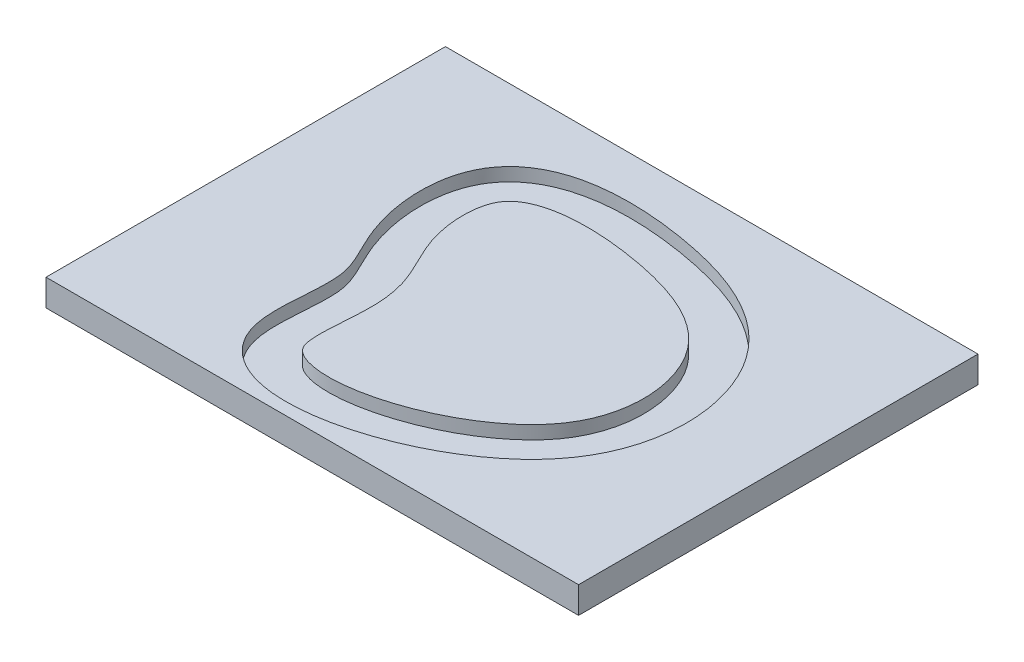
ISO-10303-21;
HEADER;
FILE_DESCRIPTION(('STEP AP214'),'2;1');
FILE_NAME('part.step','',(''),(''),'','','');
FILE_SCHEMA(('AUTOMOTIVE_DESIGN { 1 0 10303 214 1 1 1 1 }'));
ENDSEC;
DATA;
#1=APPLICATION_CONTEXT('core data for automotive mechanical design processes');
#2=APPLICATION_PROTOCOL_DEFINITION('international standard','automotive_design',2000,#1);
#3=PRODUCT_CONTEXT('',#1,'mechanical');
#4=PRODUCT('Part','Part','',(#3));
#5=PRODUCT_RELATED_PRODUCT_CATEGORY('part','',(#4));
#6=PRODUCT_DEFINITION_FORMATION('','',#4);
#7=PRODUCT_DEFINITION_CONTEXT('part definition',#1,'design');
#8=PRODUCT_DEFINITION('design','',#6,#7);
#9=PRODUCT_DEFINITION_SHAPE('','',#8);
#10=(LENGTH_UNIT() NAMED_UNIT(*) SI_UNIT(.MILLI.,.METRE.));
#11=(NAMED_UNIT(*) PLANE_ANGLE_UNIT() SI_UNIT($,.RADIAN.));
#12=(NAMED_UNIT(*) SI_UNIT($,.STERADIAN.) SOLID_ANGLE_UNIT());
#13=UNCERTAINTY_MEASURE_WITH_UNIT(LENGTH_MEASURE(1.E-05),#10,'distance_accuracy_value','');
#14=(GEOMETRIC_REPRESENTATION_CONTEXT(3) GLOBAL_UNCERTAINTY_ASSIGNED_CONTEXT((#13)) GLOBAL_UNIT_ASSIGNED_CONTEXT((#10,
#11,#12)) REPRESENTATION_CONTEXT('',''));
#15=CARTESIAN_POINT('',(0.,0.,0.));
#16=DIRECTION('',(0.,0.,1.));
#17=DIRECTION('',(1.,0.,0.));
#18=AXIS2_PLACEMENT_3D('',#15,#16,#17);
#19=CARTESIAN_POINT('',(-100.,10.,75.));
#20=DIRECTION('',(1.,0.,0.));
#21=DIRECTION('',(0.,0.,-1.));
#22=AXIS2_PLACEMENT_3D('',#19,#20,#21);
#23=PLANE('',#22);
#24=DIRECTION('',(0.,0.,1.));
#25=VECTOR('',#24,1.);
#26=CARTESIAN_POINT('',(-100.,0.,75.));
#27=LINE('',#26,#25);
#28=CARTESIAN_POINT('',(-100.,0.,-75.));
#29=VERTEX_POINT('',#28);
#30=CARTESIAN_POINT('',(-100.,0.,75.));
#31=VERTEX_POINT('',#30);
#32=EDGE_CURVE('E165',#29,#31,#27,.T.);
#33=ORIENTED_EDGE('',*,*,#32,.T.);
#34=DIRECTION('',(0.,-1.,0.));
#35=VECTOR('',#34,1.);
#36=CARTESIAN_POINT('',(-100.,10.,75.));
#37=LINE('',#36,#35);
#38=CARTESIAN_POINT('',(-100.,10.,75.));
#39=VERTEX_POINT('',#38);
#40=EDGE_CURVE('E13',#39,#31,#37,.T.);
#41=ORIENTED_EDGE('',*,*,#40,.F.);
#42=DIRECTION('',(0.,0.,1.));
#43=VECTOR('',#42,1.);
#44=CARTESIAN_POINT('',(-100.,10.,75.));
#45=LINE('',#44,#43);
#46=CARTESIAN_POINT('',(-100.,10.,-75.));
#47=VERTEX_POINT('',#46);
#48=EDGE_CURVE('E152',#47,#39,#45,.T.);
#49=ORIENTED_EDGE('',*,*,#48,.F.);
#50=DIRECTION('',(0.,-1.,0.));
#51=VECTOR('',#50,1.);
#52=CARTESIAN_POINT('',(-100.,10.,-75.));
#53=LINE('',#52,#51);
#54=EDGE_CURVE('E161',#47,#29,#53,.T.);
#55=ORIENTED_EDGE('',*,*,#54,.T.);
#56=EDGE_LOOP('',(#33,#41,#49,#55));
#57=FACE_BOUND('',#56,.T.);
#58=ADVANCED_FACE('F95',(#57),#23,.F.);
#59=CARTESIAN_POINT('',(100.,10.,75.));
#60=DIRECTION('',(0.,0.,-1.));
#61=DIRECTION('',(-1.,0.,0.));
#62=AXIS2_PLACEMENT_3D('',#59,#60,#61);
#63=PLANE('',#62);
#64=DIRECTION('',(1.,0.,0.));
#65=VECTOR('',#64,1.);
#66=CARTESIAN_POINT('',(100.,0.,75.));
#67=LINE('',#66,#65);
#68=CARTESIAN_POINT('',(100.,0.,75.));
#69=VERTEX_POINT('',#68);
#70=EDGE_CURVE('E156',#31,#69,#67,.T.);
#71=ORIENTED_EDGE('',*,*,#70,.T.);
#72=DIRECTION('',(0.,-1.,0.));
#73=VECTOR('',#72,1.);
#74=CARTESIAN_POINT('',(100.,10.,75.));
#75=LINE('',#74,#73);
#76=CARTESIAN_POINT('',(100.,10.,75.));
#77=VERTEX_POINT('',#76);
#78=EDGE_CURVE('E108',#77,#69,#75,.T.);
#79=ORIENTED_EDGE('',*,*,#78,.F.);
#80=DIRECTION('',(1.,0.,0.));
#81=VECTOR('',#80,1.);
#82=CARTESIAN_POINT('',(100.,10.,75.));
#83=LINE('',#82,#81);
#84=EDGE_CURVE('E147',#39,#77,#83,.T.);
#85=ORIENTED_EDGE('',*,*,#84,.F.);
#86=ORIENTED_EDGE('',*,*,#40,.T.);
#87=EDGE_LOOP('',(#71,#79,#85,#86));
#88=FACE_BOUND('',#87,.T.);
#89=ADVANCED_FACE('F155',(#88),#63,.F.);
#90=CARTESIAN_POINT('',(100.,10.,75.));
#91=DIRECTION('',(-1.,0.,0.));
#92=DIRECTION('',(0.,0.,1.));
#93=AXIS2_PLACEMENT_3D('',#90,#91,#92);
#94=PLANE('',#93);
#95=DIRECTION('',(0.,0.,-1.));
#96=VECTOR('',#95,1.);
#97=CARTESIAN_POINT('',(100.,0.,75.));
#98=LINE('',#97,#96);
#99=CARTESIAN_POINT('',(100.,0.,-75.));
#100=VERTEX_POINT('',#99);
#101=EDGE_CURVE('E134',#69,#100,#98,.T.);
#102=ORIENTED_EDGE('',*,*,#101,.T.);
#103=DIRECTION('',(0.,-1.,0.));
#104=VECTOR('',#103,1.);
#105=CARTESIAN_POINT('',(100.,10.,-75.));
#106=LINE('',#105,#104);
#107=CARTESIAN_POINT('',(100.,10.,-75.));
#108=VERTEX_POINT('',#107);
#109=EDGE_CURVE('E157',#108,#100,#106,.T.);
#110=ORIENTED_EDGE('',*,*,#109,.F.);
#111=DIRECTION('',(0.,0.,-1.));
#112=VECTOR('',#111,1.);
#113=CARTESIAN_POINT('',(100.,10.,75.));
#114=LINE('',#113,#112);
#115=EDGE_CURVE('E150',#77,#108,#114,.T.);
#116=ORIENTED_EDGE('',*,*,#115,.F.);
#117=ORIENTED_EDGE('',*,*,#78,.T.);
#118=EDGE_LOOP('',(#102,#110,#116,#117));
#119=FACE_BOUND('',#118,.T.);
#120=ADVANCED_FACE('F159',(#119),#94,.F.);
#121=CARTESIAN_POINT('',(100.,10.,-75.));
#122=DIRECTION('',(0.,0.,1.));
#123=DIRECTION('',(1.,0.,0.));
#124=AXIS2_PLACEMENT_3D('',#121,#122,#123);
#125=PLANE('',#124);
#126=DIRECTION('',(-1.,0.,0.));
#127=VECTOR('',#126,1.);
#128=CARTESIAN_POINT('',(100.,0.,-75.));
#129=LINE('',#128,#127);
#130=EDGE_CURVE('E140',#100,#29,#129,.T.);
#131=ORIENTED_EDGE('',*,*,#130,.T.);
#132=ORIENTED_EDGE('',*,*,#54,.F.);
#133=DIRECTION('',(-1.,0.,0.));
#134=VECTOR('',#133,1.);
#135=CARTESIAN_POINT('',(100.,10.,-75.));
#136=LINE('',#135,#134);
#137=EDGE_CURVE('E117',#108,#47,#136,.T.);
#138=ORIENTED_EDGE('',*,*,#137,.F.);
#139=ORIENTED_EDGE('',*,*,#109,.T.);
#140=EDGE_LOOP('',(#131,#132,#138,#139));
#141=FACE_BOUND('',#140,.T.);
#142=ADVANCED_FACE('F221',(#141),#125,.F.);
#143=CARTESIAN_POINT('',(-100.,10.,-75.));
#144=DIRECTION('',(0.,1.,0.));
#145=DIRECTION('',(0.,0.,1.));
#146=AXIS2_PLACEMENT_3D('',#143,#144,#145);
#147=PLANE('',#146);
#148=CARTESIAN_POINT('',(-47.7977248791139,10.,11.1930887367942));
#149=CARTESIAN_POINT('',(-47.6738011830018,10.,11.477453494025));
#150=CARTESIAN_POINT('',(-47.5522566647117,10.,11.762857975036));
#151=CARTESIAN_POINT('',(-47.3150202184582,10.,12.3361530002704));
#152=CARTESIAN_POINT('',(-47.1993292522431,10.,12.6240439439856));
#153=CARTESIAN_POINT('',(-46.9751526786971,10.,13.2024058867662));
#154=CARTESIAN_POINT('',(-46.8666622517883,10.,13.4928750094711));
#155=CARTESIAN_POINT('',(-46.6583646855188,10.,14.0765311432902));
#156=CARTESIAN_POINT('',(-46.5585472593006,10.,14.3697144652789));
#157=CARTESIAN_POINT('',(-46.3691380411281,10.,14.9589637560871));
#158=CARTESIAN_POINT('',(-46.2795330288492,10.,15.255025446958));
#159=CARTESIAN_POINT('',(-46.1122764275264,10.,15.8502321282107));
#160=CARTESIAN_POINT('',(-46.0346139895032,10.,16.149374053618));
#161=CARTESIAN_POINT('',(-45.8921404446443,10.,16.7495577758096));
#162=CARTESIAN_POINT('',(-45.8272837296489,10.,17.050588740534));
#163=CARTESIAN_POINT('',(-45.7099200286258,10.,17.6553021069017));
#164=CARTESIAN_POINT('',(-45.6574234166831,10.,17.9589865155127));
#165=CARTESIAN_POINT('',(-45.5640206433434,10.,18.5684858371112));
#166=CARTESIAN_POINT('',(-45.5231282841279,10.,18.8743028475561));
#167=CARTESIAN_POINT('',(-45.451647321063,10.,19.4874893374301));
#168=CARTESIAN_POINT('',(-45.4210710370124,10.,19.7948602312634));
#169=CARTESIAN_POINT('',(-45.3686163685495,10.,20.410550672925));
#170=CARTESIAN_POINT('',(-45.3467442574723,10.,20.7188707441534));
#171=CARTESIAN_POINT('',(-45.3103166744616,10.,21.3358870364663));
#172=CARTESIAN_POINT('',(-45.2957601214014,10.,21.6445831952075));
#173=CARTESIAN_POINT('',(-45.2717763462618,10.,22.2925660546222));
#174=CARTESIAN_POINT('',(-45.262994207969,10.,22.6318761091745));
#175=CARTESIAN_POINT('',(-45.2518684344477,10.,23.3106079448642));
#176=CARTESIAN_POINT('',(-45.2495250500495,10.,23.6500297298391));
#177=CARTESIAN_POINT('',(-45.2504049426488,10.,24.3285079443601));
#178=CARTESIAN_POINT('',(-45.253622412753,10.,24.6675643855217));
#179=CARTESIAN_POINT('',(-45.2649375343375,10.,25.3455878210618));
#180=CARTESIAN_POINT('',(-45.2730351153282,10.,25.6845548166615));
#181=CARTESIAN_POINT('',(-45.2934414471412,10.,26.3623485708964));
#182=CARTESIAN_POINT('',(-45.3057500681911,10.,26.701175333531));
#183=CARTESIAN_POINT('',(-45.3338047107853,10.,27.378685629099));
#184=CARTESIAN_POINT('',(-45.3495507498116,10.,27.717369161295));
#185=CARTESIAN_POINT('',(-45.400893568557,10.,28.7334285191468));
#186=CARTESIAN_POINT('',(-45.4405875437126,10.,29.4105947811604));
#187=CARTESIAN_POINT('',(-45.5258860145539,10.,30.7647521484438));
#188=CARTESIAN_POINT('',(-45.5714923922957,10.,31.4417431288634));
#189=CARTESIAN_POINT('',(-45.6645241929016,10.,32.8010776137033));
#190=CARTESIAN_POINT('',(-45.7119613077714,10.,33.4834203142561));
#191=CARTESIAN_POINT('',(-45.7808356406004,10.,34.5070219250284));
#192=CARTESIAN_POINT('',(-45.8034114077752,10.,34.8482032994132));
#193=CARTESIAN_POINT('',(-45.8473165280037,10.,35.5306471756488));
#194=CARTESIAN_POINT('',(-45.868645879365,10.,35.8719096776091));
#195=CARTESIAN_POINT('',(-45.9096252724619,10.,36.5543912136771));
#196=CARTESIAN_POINT('',(-45.9292760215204,10.,36.8956102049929));
#197=CARTESIAN_POINT('',(-45.9663320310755,10.,37.578171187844));
#198=CARTESIAN_POINT('',(-45.9837372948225,10.,37.9195131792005));
#199=CARTESIAN_POINT('',(-46.015523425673,10.,38.6021839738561));
#200=CARTESIAN_POINT('',(-46.029905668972,10.,38.9435127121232));
#201=CARTESIAN_POINT('',(-46.0550189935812,10.,39.6263072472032));
#202=CARTESIAN_POINT('',(-46.0657500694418,10.,39.96777304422));
#203=CARTESIAN_POINT('',(-46.0829692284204,10.,40.6507746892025));
#204=CARTESIAN_POINT('',(-46.0894577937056,10.,40.9923105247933));
#205=CARTESIAN_POINT('',(-46.0977466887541,10.,41.6754399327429));
#206=CARTESIAN_POINT('',(-46.0995470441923,10.,42.0170335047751));
#207=CARTESIAN_POINT('',(-46.0980347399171,10.,42.6161567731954));
#208=CARTESIAN_POINT('',(-46.095871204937,10.,42.8736888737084));
#209=CARTESIAN_POINT('',(-46.0880499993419,10.,43.3886966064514));
#210=CARTESIAN_POINT('',(-46.0823923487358,10.,43.6461722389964));
#211=CARTESIAN_POINT('',(-46.0596237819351,10.,44.4185435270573));
#212=CARTESIAN_POINT('',(-46.0367172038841,10.,44.9332947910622));
#213=CARTESIAN_POINT('',(-45.9890989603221,10.,45.7046739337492));
#214=CARTESIAN_POINT('',(-45.9710117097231,10.,45.9617252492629));
#215=CARTESIAN_POINT('',(-45.9302369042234,10.,46.4754712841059));
#216=CARTESIAN_POINT('',(-45.9075492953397,10.,46.732165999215));
#217=CARTESIAN_POINT('',(-45.869996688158,10.,47.1165475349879));
#218=CARTESIAN_POINT('',(-45.8569102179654,10.,47.2444105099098));
#219=CARTESIAN_POINT('',(-45.8295394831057,10.,47.5000080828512));
#220=CARTESIAN_POINT('',(-45.8152552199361,10.,47.627742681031));
#221=CARTESIAN_POINT('',(-45.770446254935,10.,48.0107161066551));
#222=CARTESIAN_POINT('',(-45.7379648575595,10.,48.2657299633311));
#223=CARTESIAN_POINT('',(-45.6670915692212,10.,48.7748789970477));
#224=CARTESIAN_POINT('',(-45.6287010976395,10.,49.0290143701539));
#225=CARTESIAN_POINT('',(-45.545430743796,10.,49.5362154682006));
#226=CARTESIAN_POINT('',(-45.5005508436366,10.,49.789281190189));
#227=CARTESIAN_POINT('',(-45.3554722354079,10.,50.5463095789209));
#228=CARTESIAN_POINT('',(-45.2448040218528,10.,51.0483302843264));
#229=CARTESIAN_POINT('',(-45.0144343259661,10.,51.9604215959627));
#230=CARTESIAN_POINT('',(-44.8994285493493,10.,52.371679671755));
#231=CARTESIAN_POINT('',(-44.7108823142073,10.,52.983654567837));
#232=CARTESIAN_POINT('',(-44.6453487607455,10.,53.1868599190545));
#233=CARTESIAN_POINT('',(-44.5090159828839,10.,53.5914931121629));
#234=CARTESIAN_POINT('',(-44.4382167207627,10.,53.7929209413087));
#235=CARTESIAN_POINT('',(-44.217931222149,10.,54.3943569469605));
#236=CARTESIAN_POINT('',(-44.0605543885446,10.,54.7915270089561));
#237=CARTESIAN_POINT('',(-43.8084621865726,10.,55.3802593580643));
#238=CARTESIAN_POINT('',(-43.7217749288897,10.,55.5753034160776));
#239=CARTESIAN_POINT('',(-43.5429167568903,10.,55.9628705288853));
#240=CARTESIAN_POINT('',(-43.4507458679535,10.,56.1553935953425));
#241=CARTESIAN_POINT('',(-43.2607848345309,10.,56.537610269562));
#242=CARTESIAN_POINT('',(-43.1629955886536,10.,56.7273043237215));
#243=CARTESIAN_POINT('',(-42.9616367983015,10.,57.1035971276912));
#244=CARTESIAN_POINT('',(-42.8580673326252,10.,57.2901959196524));
#245=CARTESIAN_POINT('',(-42.6453647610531,10.,57.6601648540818));
#246=CARTESIAN_POINT('',(-42.5362323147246,10.,57.8435353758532));
#247=CARTESIAN_POINT('',(-42.3125497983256,10.,58.206951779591));
#248=CARTESIAN_POINT('',(-42.1979994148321,10.,58.3869974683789));
#249=CARTESIAN_POINT('',(-41.9047032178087,10.,58.8333100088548));
#250=CARTESIAN_POINT('',(-41.722641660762,10.,59.0974072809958));
#251=CARTESIAN_POINT('',(-41.3470909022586,10.,59.6173579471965));
#252=CARTESIAN_POINT('',(-41.1536011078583,10.,59.8732109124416));
#253=CARTESIAN_POINT('',(-40.7554966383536,10.,60.3761913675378));
#254=CARTESIAN_POINT('',(-40.550879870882,10.,60.6233172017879));
#255=CARTESIAN_POINT('',(-40.1310890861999,10.,61.1084246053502));
#256=CARTESIAN_POINT('',(-39.9159151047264,10.,61.3464062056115));
#257=CARTESIAN_POINT('',(-39.4754846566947,10.,61.8132379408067));
#258=CARTESIAN_POINT('',(-39.2502195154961,10.,62.0420798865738));
#259=CARTESIAN_POINT('',(-38.7903373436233,10.,62.4901620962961));
#260=CARTESIAN_POINT('',(-38.555720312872,10.,62.709402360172));
#261=CARTESIAN_POINT('',(-38.0776603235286,10.,63.1379693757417));
#262=CARTESIAN_POINT('',(-37.8342186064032,10.,63.3472975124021));
#263=CARTESIAN_POINT('',(-37.3389248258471,10.,63.7557475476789));
#264=CARTESIAN_POINT('',(-37.0870728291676,10.,63.9548695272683));
#265=CARTESIAN_POINT('',(-36.5794353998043,10.,64.3399537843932));
#266=CARTESIAN_POINT('',(-36.3237655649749,10.,64.526068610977));
#267=CARTESIAN_POINT('',(-35.8054863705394,10.,64.8883653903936));
#268=CARTESIAN_POINT('',(-35.5428769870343,10.,65.0645473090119));
#269=CARTESIAN_POINT('',(-35.0112979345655,10.,65.4070558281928));
#270=CARTESIAN_POINT('',(-34.7423279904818,10.,65.5733820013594));
#271=CARTESIAN_POINT('',(-34.1986074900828,10.,65.8962925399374));
#272=CARTESIAN_POINT('',(-33.9238569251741,10.,66.0528768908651));
#273=CARTESIAN_POINT('',(-33.3691980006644,10.,66.3564132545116));
#274=CARTESIAN_POINT('',(-33.0892912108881,10.,66.5033681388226));
#275=CARTESIAN_POINT('',(-32.5247632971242,10.,66.7879102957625));
#276=CARTESIAN_POINT('',(-32.2401421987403,10.,66.9254976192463));
#277=CARTESIAN_POINT('',(-31.6666002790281,10.,67.1914158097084));
#278=CARTESIAN_POINT('',(-31.3776793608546,10.,67.3197464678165));
#279=CARTESIAN_POINT('',(-30.7959258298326,10.,67.5672166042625));
#280=CARTESIAN_POINT('',(-30.5030930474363,10.,67.6863556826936));
#281=CARTESIAN_POINT('',(-29.7141637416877,10.,67.9933195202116));
#282=CARTESIAN_POINT('',(-29.2148496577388,10.,68.172954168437));
#283=CARTESIAN_POINT('',(-28.4598888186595,10.,68.4242623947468));
#284=CARTESIAN_POINT('',(-28.2072073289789,10.,68.5050161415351));
#285=CARTESIAN_POINT('',(-27.7000466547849,10.,68.6607014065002));
#286=CARTESIAN_POINT('',(-27.4455674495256,10.,68.7356328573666));
#287=CARTESIAN_POINT('',(-26.9349067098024,10.,68.8799632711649));
#288=CARTESIAN_POINT('',(-26.6787243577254,10.,68.9493593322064));
#289=CARTESIAN_POINT('',(-26.1649751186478,10.,69.0828147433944));
#290=CARTESIAN_POINT('',(-25.9074082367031,10.,69.1468741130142));
#291=CARTESIAN_POINT('',(-25.3910352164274,10.,69.2697026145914));
#292=CARTESIAN_POINT('',(-25.1322291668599,10.,69.3284721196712));
#293=CARTESIAN_POINT('',(-24.6134983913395,10.,69.4408264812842));
#294=CARTESIAN_POINT('',(-24.3535736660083,10.,69.4944113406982));
#295=CARTESIAN_POINT('',(-23.5708166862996,10.,69.6478496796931));
#296=CARTESIAN_POINT('',(-23.0464656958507,10.,69.7400401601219));
#297=CARTESIAN_POINT('',(-21.9947539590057,10.,69.9051929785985));
#298=CARTESIAN_POINT('',(-21.4673931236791,10.,69.9781547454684));
#299=CARTESIAN_POINT('',(-20.6748178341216,10.,70.074333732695));
#300=CARTESIAN_POINT('',(-20.4103888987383,10.,70.1041811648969));
#301=CARTESIAN_POINT('',(-19.8810871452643,10.,70.159639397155));
#302=CARTESIAN_POINT('',(-19.6162143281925,10.,70.185250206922));
#303=CARTESIAN_POINT('',(-18.8210517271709,10.,70.2558172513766));
#304=CARTESIAN_POINT('',(-18.2901970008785,10.,70.294510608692));
#305=CARTESIAN_POINT('',(-17.1323992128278,10.,70.3614603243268));
#306=CARTESIAN_POINT('',(-16.5052766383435,10.,70.3866057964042));
#307=CARTESIAN_POINT('',(-15.2505646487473,10.,70.4162599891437));
#308=CARTESIAN_POINT('',(-14.6229752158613,10.,70.4207678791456));
#309=CARTESIAN_POINT('',(-12.7396488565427,10.,70.4060780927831));
#310=CARTESIAN_POINT('',(-11.4840176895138,10.,70.35863235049));
#311=CARTESIAN_POINT('',(-9.60404699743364,10.,70.2364133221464));
#312=CARTESIAN_POINT('',(-8.97786077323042,10.,70.1871522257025));
#313=CARTESIAN_POINT('',(-7.72691325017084,10.,70.0727506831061));
#314=CARTESIAN_POINT('',(-7.10215196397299,10.,70.0076100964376));
#315=CARTESIAN_POINT('',(-5.85296844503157,10.,69.8622544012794));
#316=CARTESIAN_POINT('',(-5.2285501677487,10.,69.7820055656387));
#317=CARTESIAN_POINT('',(-3.98174226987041,10.,69.6070848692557));
#318=CARTESIAN_POINT('',(-3.35935263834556,10.,69.5124130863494));
#319=CARTESIAN_POINT('',(-2.11705778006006,10.,69.3093652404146));
#320=CARTESIAN_POINT('',(-1.49715171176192,10.,69.2009943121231));
#321=CARTESIAN_POINT('',(-0.259749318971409,10.,68.9712861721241));
#322=CARTESIAN_POINT('',(0.357746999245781,10.,68.8499489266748));
#323=CARTESIAN_POINT('',(1.5901747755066,10.,68.5947860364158));
#324=CARTESIAN_POINT('',(2.20510614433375,10.,68.4609599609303));
#325=CARTESIAN_POINT('',(3.43219144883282,10.,68.1811437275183));
#326=CARTESIAN_POINT('',(4.04434537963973,10.,68.0351535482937));
#327=CARTESIAN_POINT('',(5.38903686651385,10.,67.7007269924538));
#328=CARTESIAN_POINT('',(6.12092494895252,10.,67.5096719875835));
#329=CARTESIAN_POINT('',(7.58024752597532,10.,67.1112244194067));
#330=CARTESIAN_POINT('',(8.30768182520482,10.,66.9038311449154));
#331=CARTESIAN_POINT('',(10.4835192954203,10.,66.2581306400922));
#332=CARTESIAN_POINT('',(11.9250720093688,10.,65.7963992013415));
#333=CARTESIAN_POINT('',(14.0719856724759,10.,65.0586166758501));
#334=CARTESIAN_POINT('',(14.7852042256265,10.,64.8050996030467));
#335=CARTESIAN_POINT('',(16.2062336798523,10.,64.2832797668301));
#336=CARTESIAN_POINT('',(16.9140445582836,10.,64.0149769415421));
#337=CARTESIAN_POINT('',(18.3241977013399,10.,63.4638657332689));
#338=CARTESIAN_POINT('',(19.0265385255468,10.,63.1810536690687));
#339=CARTESIAN_POINT('',(20.4253036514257,10.,62.6011584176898));
#340=CARTESIAN_POINT('',(21.1217279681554,10.,62.3040752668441));
#341=CARTESIAN_POINT('',(22.5081812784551,10.,61.6956887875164));
#342=CARTESIAN_POINT('',(23.1982114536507,10.,61.3843881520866));
#343=CARTESIAN_POINT('',(24.5716816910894,10.,60.7475692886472));
#344=CARTESIAN_POINT('',(25.2551217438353,10.,60.422051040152));
#345=CARTESIAN_POINT('',(26.6149069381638,10.,59.7569462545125));
#346=CARTESIAN_POINT('',(27.291253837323,10.,59.4173633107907));
#347=CARTESIAN_POINT('',(28.6367060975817,10.,58.7241402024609));
#348=CARTESIAN_POINT('',(29.3058114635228,10.,58.3705000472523));
#349=CARTESIAN_POINT('',(30.6360405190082,10.,57.6490908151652));
#350=CARTESIAN_POINT('',(31.2971671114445,10.,57.2813270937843));
#351=CARTESIAN_POINT('',(32.6111921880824,10.,56.5313778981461));
#352=CARTESIAN_POINT('',(33.2640906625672,10.,56.1491924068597));
#353=CARTESIAN_POINT('',(34.5609578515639,10.,55.3703660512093));
#354=CARTESIAN_POINT('',(35.2049291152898,10.,54.9737294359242));
#355=CARTESIAN_POINT('',(36.4836218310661,10.,54.165856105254));
#356=CARTESIAN_POINT('',(37.1183433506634,10.,53.754619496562));
#357=CARTESIAN_POINT('',(38.8126479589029,10.,52.6283133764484));
#358=CARTESIAN_POINT('',(39.8631305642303,10.,51.8994263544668));
#359=CARTESIAN_POINT('',(41.4147885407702,10.,50.7731901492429));
#360=CARTESIAN_POINT('',(41.9279901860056,10.,50.3922991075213));
#361=CARTESIAN_POINT('',(42.9459560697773,10.,49.619373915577));
#362=CARTESIAN_POINT('',(43.4507202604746,10.,49.2273397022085));
#363=CARTESIAN_POINT('',(44.4514133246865,10.,48.4319879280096));
#364=CARTESIAN_POINT('',(44.9473407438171,10.,48.0286685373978));
#365=CARTESIAN_POINT('',(45.9297230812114,10.,47.2106480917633));
#366=CARTESIAN_POINT('',(46.4161780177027,10.,46.7959470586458));
#367=CARTESIAN_POINT('',(47.3772904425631,10.,45.9561038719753));
#368=CARTESIAN_POINT('',(47.8519804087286,10.,45.5309989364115));
#369=CARTESIAN_POINT('',(48.7903750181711,10.,44.6688516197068));
#370=CARTESIAN_POINT('',(49.2540797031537,10.,44.2318092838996));
#371=CARTESIAN_POINT('',(50.6274698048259,10.,42.9025380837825));
#372=CARTESIAN_POINT('',(51.5195961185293,10.,41.9920215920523));
#373=CARTESIAN_POINT('',(53.2507678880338,10.,40.1220958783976));
#374=CARTESIAN_POINT('',(54.089827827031,9.99999999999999,39.1627001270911));
#375=CARTESIAN_POINT('',(55.231663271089,9.99999999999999,37.7723179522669));
#376=CARTESIAN_POINT('',(55.5598712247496,10.,37.3620696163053));
#377=CARTESIAN_POINT('',(56.2052607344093,10.,36.5329780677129));
#378=CARTESIAN_POINT('',(56.5224424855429,10.,36.1141350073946));
#379=CARTESIAN_POINT('',(57.1450715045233,10.,35.2678472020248));
#380=CARTESIAN_POINT('',(57.450519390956,10.,34.8404029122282));
#381=CARTESIAN_POINT('',(58.0490795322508,10.,33.9769584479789));
#382=CARTESIAN_POINT('',(58.3421917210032,10.,33.5409582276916));
#383=CARTESIAN_POINT('',(58.9159560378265,10.,32.6608628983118));
#384=CARTESIAN_POINT('',(59.1966087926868,10.,32.2167681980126));
#385=CARTESIAN_POINT('',(59.7452544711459,10.,31.3208441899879));
#386=CARTESIAN_POINT('',(60.013247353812,10.,30.8690148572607));
#387=CARTESIAN_POINT('',(60.7980460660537,10.,29.5022351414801));
#388=CARTESIAN_POINT('',(61.2955930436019,10.,28.5761141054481));
#389=CARTESIAN_POINT('',(62.2368631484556,10.,26.696841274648));
#390=CARTESIAN_POINT('',(62.6805794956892,10.,25.743686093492));
#391=CARTESIAN_POINT('',(63.5130727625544,10.,23.8136124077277));
#392=CARTESIAN_POINT('',(63.901848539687,10.,22.8366934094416));
#393=CARTESIAN_POINT('',(64.5330661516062,10.,21.109737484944));
#394=CARTESIAN_POINT('',(64.7877717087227,10.,20.3641530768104));
#395=CARTESIAN_POINT('',(65.2654462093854,10.,18.8628185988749));
#396=CARTESIAN_POINT('',(65.488413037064,10.,18.1070678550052));
#397=CARTESIAN_POINT('',(65.9024648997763,10.,16.5869342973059));
#398=CARTESIAN_POINT('',(66.0935521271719,10.,15.8225520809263));
#399=CARTESIAN_POINT('',(66.4437090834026,10.,14.2865555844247));
#400=CARTESIAN_POINT('',(66.6027794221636,10.,13.514941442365));
#401=CARTESIAN_POINT('',(67.0318649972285,10.,11.1902991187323));
#402=CARTESIAN_POINT('',(67.2535904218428,10.,9.62807551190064));
#403=CARTESIAN_POINT('',(67.5686101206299,10.,6.49092515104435));
#404=CARTESIAN_POINT('',(67.6618994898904,10.,4.91599791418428));
#405=CARTESIAN_POINT('',(67.7213441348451,10.,1.74004475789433));
#406=CARTESIAN_POINT('',(67.6855648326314,10.,0.13898279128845));
#407=CARTESIAN_POINT('',(67.4838516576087,10.,-3.05508602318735));
#408=CARTESIAN_POINT('',(67.3179183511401,10.,-4.64809290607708));
#409=CARTESIAN_POINT('',(66.9721312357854,10.,-7.02352962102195));
#410=CARTESIAN_POINT('',(66.8406544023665,10.,-7.81328588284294));
#411=CARTESIAN_POINT('',(66.5455423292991,10.,-9.38683440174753));
#412=CARTESIAN_POINT('',(66.3819065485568,10.,-10.1706265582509));
#413=CARTESIAN_POINT('',(66.0225883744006,10.,-11.7308794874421));
#414=CARTESIAN_POINT('',(65.8269034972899,10.,-12.5073396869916));
#415=CARTESIAN_POINT('',(65.4035452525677,10.,-14.0514658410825));
#416=CARTESIAN_POINT('',(65.1758737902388,10.,-14.8191323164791));
#417=CARTESIAN_POINT('',(64.7645532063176,10.,-16.1067451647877));
#418=CARTESIAN_POINT('',(64.5892763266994,10.,-16.6293827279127));
#419=CARTESIAN_POINT('',(64.223675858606,10.,-17.669354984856));
#420=CARTESIAN_POINT('',(64.0333528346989,10.,-18.1866898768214));
#421=CARTESIAN_POINT('',(63.6375878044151,10.,-19.2155667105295));
#422=CARTESIAN_POINT('',(63.4321453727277,10.,-19.7271084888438));
#423=CARTESIAN_POINT('',(63.0061327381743,10.,-20.7438396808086));
#424=CARTESIAN_POINT('',(62.7855624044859,10.,-21.2490290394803));
#425=CARTESIAN_POINT('',(62.1011523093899,10.,-22.7543168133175));
#426=CARTESIAN_POINT('',(61.6145852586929,10.,-23.744208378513));
#427=CARTESIAN_POINT('',(60.5822962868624,10.,-25.6905038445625));
#428=CARTESIAN_POINT('',(60.0366740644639,10.,-26.6469606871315));
#429=CARTESIAN_POINT('',(58.8855818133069,10.,-28.5231509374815));
#430=CARTESIAN_POINT('',(58.2801158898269,10.,-29.4428868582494));
#431=CARTESIAN_POINT('',(57.0094010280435,10.,-31.2399742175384));
#432=CARTESIAN_POINT('',(56.3441628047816,9.99999999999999,-32.1173332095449));
#433=CARTESIAN_POINT('',(55.3364135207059,10.,-33.3604746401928));
#434=CARTESIAN_POINT('',(55.0158203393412,10.,-33.7442346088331));
#435=CARTESIAN_POINT('',(54.3634890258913,10.,-34.5021806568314));
#436=CARTESIAN_POINT('',(54.0317510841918,10.,-34.8763668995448));
#437=CARTESIAN_POINT('',(53.3574056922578,10.,-35.614834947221));
#438=CARTESIAN_POINT('',(53.0147977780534,10.,-35.9791163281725));
#439=CARTESIAN_POINT('',(52.3190478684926,10.,-36.697479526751));
#440=CARTESIAN_POINT('',(51.9659058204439,10.,-37.0515612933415));
#441=CARTESIAN_POINT('',(51.2496423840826,10.,-37.7494220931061));
#442=CARTESIAN_POINT('',(50.8865217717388,10.,-38.0932019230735));
#443=CARTESIAN_POINT('',(50.1507445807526,10.,-38.770396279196));
#444=CARTESIAN_POINT('',(49.778087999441,10.,-39.1038108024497));
#445=CARTESIAN_POINT('',(49.0237332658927,10.,-39.7601752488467));
#446=CARTESIAN_POINT('',(48.6420360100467,10.,-40.0831262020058));
#447=CARTESIAN_POINT('',(47.8700020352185,10.,-40.7185061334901));
#448=CARTESIAN_POINT('',(47.479665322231,10.,-41.0309351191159));
#449=CARTESIAN_POINT('',(46.2963594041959,10.,-41.9524447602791));
#450=CARTESIAN_POINT('',(45.4910477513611,10.,-42.5457886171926));
#451=CARTESIAN_POINT('',(43.8515798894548,10.,-43.6910906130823));
#452=CARTESIAN_POINT('',(43.0174208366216,10.,-44.243044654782));
#453=CARTESIAN_POINT('',(40.9594938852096,10.,-45.53524752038));
#454=CARTESIAN_POINT('',(39.7224060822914,10.,-46.2544278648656));
#455=CARTESIAN_POINT('',(37.8349085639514,10.,-47.273948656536));
#456=CARTESIAN_POINT('',(37.2002602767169,10.,-47.6039931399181));
#457=CARTESIAN_POINT('',(35.9213772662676,10.,-48.2450100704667));
#458=CARTESIAN_POINT('',(35.2771426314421,10.,-48.5559826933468));
#459=CARTESIAN_POINT('',(33.9801008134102,10.,-49.1595871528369));
#460=CARTESIAN_POINT('',(33.3272929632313,10.,-49.4522175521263));
#461=CARTESIAN_POINT('',(32.014119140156,10.,-50.0199873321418));
#462=CARTESIAN_POINT('',(31.3537531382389,10.,-50.2951266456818));
#463=CARTESIAN_POINT('',(30.0226881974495,10.,-50.8300092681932));
#464=CARTESIAN_POINT('',(29.3519527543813,10.,-51.0896616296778));
#465=CARTESIAN_POINT('',(28.0043858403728,10.,-51.5926037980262));
#466=CARTESIAN_POINT('',(27.3275543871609,10.,-51.8358936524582));
#467=CARTESIAN_POINT('',(25.9686403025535,10.,-52.3068133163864));
#468=CARTESIAN_POINT('',(25.2865588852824,10.,-52.5344466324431));
#469=CARTESIAN_POINT('',(23.917665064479,10.,-52.9749571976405));
#470=CARTESIAN_POINT('',(23.2308526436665,10.,-53.1878343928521));
#471=CARTESIAN_POINT('',(21.1641434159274,10.,-53.8055144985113));
#472=CARTESIAN_POINT('',(19.7779271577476,9.99999999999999,-54.1893822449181));
#473=CARTESIAN_POINT('',(17.7884326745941,10.,-54.7020045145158));
#474=CARTESIAN_POINT('',(17.1903026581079,10.,-54.8512165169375));
#475=CARTESIAN_POINT('',(15.9919310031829,10.,-55.1409456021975));
#476=CARTESIAN_POINT('',(15.3916893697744,10.,-55.2814627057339));
#477=CARTESIAN_POINT('',(14.1893507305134,10.,-55.5543603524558));
#478=CARTESIAN_POINT('',(13.5872536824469,10.,-55.6867407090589));
#479=CARTESIAN_POINT('',(12.3813782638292,10.,-55.9436066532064));
#480=CARTESIAN_POINT('',(11.7775998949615,10.,-56.0680922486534));
#481=CARTESIAN_POINT('',(10.5683307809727,10.,-56.3093291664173));
#482=CARTESIAN_POINT('',(9.96283961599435,10.,-56.4260783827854));
#483=CARTESIAN_POINT('',(8.75044808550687,10.,-56.6520072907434));
#484=CARTESIAN_POINT('',(8.14354772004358,10.,-56.7611869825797));
#485=CARTESIAN_POINT('',(6.92823775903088,10.,-56.9722453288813));
#486=CARTESIAN_POINT('',(6.31982767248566,10.,-57.0741211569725));
#487=CARTESIAN_POINT('',(5.4063567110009,10.,-57.2216163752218));
#488=CARTESIAN_POINT('',(5.10172277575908,10.,-57.2698951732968));
#489=CARTESIAN_POINT('',(4.49218569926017,10.,-57.364722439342));
#490=CARTESIAN_POINT('',(4.18728255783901,10.,-57.4112709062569));
#491=CARTESIAN_POINT('',(3.27190493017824,10.,-57.5483058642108));
#492=CARTESIAN_POINT('',(2.66102973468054,10.,-57.6361386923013));
#493=CARTESIAN_POINT('',(1.43826102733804,10.,-57.8043383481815));
#494=CARTESIAN_POINT('',(0.826367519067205,10.,-57.8847052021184));
#495=CARTESIAN_POINT('',(-1.00566078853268,10.,-58.1134107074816));
#496=CARTESIAN_POINT('',(-2.22728458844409,10.,-58.2501299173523));
#497=CARTESIAN_POINT('',(-4.06204793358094,10.,-58.4297964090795));
#498=CARTESIAN_POINT('',(-4.67396785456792,10.,-58.4854459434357));
#499=CARTESIAN_POINT('',(-5.89854011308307,10.,-58.5879691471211));
#500=CARTESIAN_POINT('',(-6.51119245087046,10.,-58.6348428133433));
#501=CARTESIAN_POINT('',(-8.34946008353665,10.,-58.7614189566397));
#502=CARTESIAN_POINT('',(-9.57609541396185,10.,-58.827147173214));
#503=CARTESIAN_POINT('',(-11.416745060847,10.,-58.8946839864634));
#504=CARTESIAN_POINT('',(-12.0302268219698,10.,-58.9120197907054));
#505=CARTESIAN_POINT('',(-13.2574175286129,10.,-58.9359000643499));
#506=CARTESIAN_POINT('',(-13.8711264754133,10.,-58.9424444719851));
#507=CARTESIAN_POINT('',(-14.7915764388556,10.,-58.9438433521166));
#508=CARTESIAN_POINT('',(-15.0983164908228,10.,-58.9429076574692));
#509=CARTESIAN_POINT('',(-15.711774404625,10.,-58.9381829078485));
#510=CARTESIAN_POINT('',(-16.0184922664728,10.,-58.9343938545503));
#511=CARTESIAN_POINT('',(-16.938566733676,10.,-58.918542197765));
#512=CARTESIAN_POINT('',(-17.5518543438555,10.,-58.9019951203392));
#513=CARTESIAN_POINT('',(-18.7445268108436,10.,-58.8571717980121));
#514=CARTESIAN_POINT('',(-19.3239374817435,10.,-58.8295840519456));
#515=CARTESIAN_POINT('',(-20.4820362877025,10.,-58.7619972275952));
#516=CARTESIAN_POINT('',(-21.0607244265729,10.,-58.7219982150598));
#517=CARTESIAN_POINT('',(-22.2170781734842,10.,-58.6288546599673));
#518=CARTESIAN_POINT('',(-22.7947437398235,10.,-58.575709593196));
#519=CARTESIAN_POINT('',(-23.9486391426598,10.,-58.4556141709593));
#520=CARTESIAN_POINT('',(-24.5248689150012,10.,-58.388663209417));
#521=CARTESIAN_POINT('',(-26.2518954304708,10.,-58.1661547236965));
#522=CARTESIAN_POINT('',(-27.4000856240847,10.,-57.9890156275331));
#523=CARTESIAN_POINT('',(-29.1129920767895,10.,-57.6730267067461));
#524=CARTESIAN_POINT('',(-29.6824254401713,10.,-57.5593102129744));
#525=CARTESIAN_POINT('',(-30.8175087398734,10.,-57.3141920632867));
#526=CARTESIAN_POINT('',(-31.3831586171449,10.,-57.1827901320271));
#527=CARTESIAN_POINT('',(-32.517293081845,10.,-56.8995418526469));
#528=CARTESIAN_POINT('',(-33.0857160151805,10.,-56.747447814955));
#529=CARTESIAN_POINT('',(-34.2166106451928,10.,-56.4225077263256));
#530=CARTESIAN_POINT('',(-34.7790824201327,10.,-56.2496619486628));
#531=CARTESIAN_POINT('',(-35.896916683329,10.,-55.8819072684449));
#532=CARTESIAN_POINT('',(-36.4522779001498,10.,-55.68699447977));
#533=CARTESIAN_POINT('',(-37.2788480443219,10.,-55.3774114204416));
#534=CARTESIAN_POINT('',(-37.5533016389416,10.,-55.2713443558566));
#535=CARTESIAN_POINT('',(-38.0998868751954,10.,-55.0533892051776));
#536=CARTESIAN_POINT('',(-38.3720185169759,10.,-54.9415011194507));
#537=CARTESIAN_POINT('',(-39.1833055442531,10.,-54.5973630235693));
#538=CARTESIAN_POINT('',(-39.7186952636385,10.,-54.356138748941));
#539=CARTESIAN_POINT('',(-40.7774325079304,10.,-53.8485285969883));
#540=CARTESIAN_POINT('',(-41.3007798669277,10.,-53.5821423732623));
#541=CARTESIAN_POINT('',(-42.3331713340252,10.,-53.0234574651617));
#542=CARTESIAN_POINT('',(-42.8422219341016,10.,-52.7311708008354));
#543=CARTESIAN_POINT('',(-43.844190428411,10.,-52.1201773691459));
#544=CARTESIAN_POINT('',(-44.3371100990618,10.,-51.8014735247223));
#545=CARTESIAN_POINT('',(-45.1474660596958,10.,-51.2449517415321));
#546=CARTESIAN_POINT('',(-45.4699399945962,10.,-51.0144477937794));
#547=CARTESIAN_POINT('',(-46.105618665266,10.,-50.5410500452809));
#548=CARTESIAN_POINT('',(-46.4188239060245,10.,-50.2981569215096));
#549=CARTESIAN_POINT('',(-47.3432135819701,10.,-49.5508460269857));
#550=CARTESIAN_POINT('',(-47.9394188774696,10.,-49.0276281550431));
#551=CARTESIAN_POINT('',(-49.0838284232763,10.,-47.9322192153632));
#552=CARTESIAN_POINT('',(-49.6320838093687,10.,-47.3600816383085));
#553=CARTESIAN_POINT('',(-50.4171079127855,10.,-46.4692032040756));
#554=CARTESIAN_POINT('',(-50.6726010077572,10.,-46.1667379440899));
#555=CARTESIAN_POINT('',(-51.1706548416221,10.,-45.5513579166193));
#556=CARTESIAN_POINT('',(-51.4132173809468,10.,-45.2384446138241));
#557=CARTESIAN_POINT('',(-51.8064020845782,10.,-44.7082037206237));
#558=CARTESIAN_POINT('',(-51.9607957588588,10.,-44.4936589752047));
#559=CARTESIAN_POINT('',(-52.2632758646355,10.,-44.0601764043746));
#560=CARTESIAN_POINT('',(-52.4113626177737,10.,-43.8412388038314));
#561=CARTESIAN_POINT('',(-52.7008987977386,10.,-43.3990492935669));
#562=CARTESIAN_POINT('',(-52.8423489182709,10.,-43.1757978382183));
#563=CARTESIAN_POINT('',(-53.118400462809,10.,-42.7250970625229));
#564=CARTESIAN_POINT('',(-53.2530017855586,10.,-42.4976476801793));
#565=CARTESIAN_POINT('',(-53.5154873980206,10.,-42.0389283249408));
#566=CARTESIAN_POINT('',(-53.6433721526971,10.,-41.8076586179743));
#567=CARTESIAN_POINT('',(-53.8925326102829,10.,-41.3415948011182));
#568=CARTESIAN_POINT('',(-54.0138083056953,10.,-41.1068006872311));
#569=CARTESIAN_POINT('',(-54.3679845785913,10.,-40.3974238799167));
#570=CARTESIAN_POINT('',(-54.5911713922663,10.,-39.9179572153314));
#571=CARTESIAN_POINT('',(-55.0126732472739,10.,-38.9481503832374));
#572=CARTESIAN_POINT('',(-55.2109835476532,10.,-38.4578081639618));
#573=CARTESIAN_POINT('',(-55.4905488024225,10.,-37.7155814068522));
#574=CARTESIAN_POINT('',(-55.5807603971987,10.,-37.4670333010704));
#575=CARTESIAN_POINT('',(-55.755358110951,10.,-36.9678851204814));
#576=CARTESIAN_POINT('',(-55.8397439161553,10.,-36.7172849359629));
#577=CARTESIAN_POINT('',(-56.0946762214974,10.,-35.9302822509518));
#578=CARTESIAN_POINT('',(-56.2549775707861,10.,-35.3905241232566));
#579=CARTESIAN_POINT('',(-56.5497503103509,10.,-34.3039753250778));
#580=CARTESIAN_POINT('',(-56.6842184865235,10.,-33.7571837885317));
#581=CARTESIAN_POINT('',(-56.9284219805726,10.,-32.6579972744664));
#582=CARTESIAN_POINT('',(-57.0381519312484,10.,-32.1056011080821));
#583=CARTESIAN_POINT('',(-57.2343951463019,10.,-30.9967324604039));
#584=CARTESIAN_POINT('',(-57.3209083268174,10.,-30.4402599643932));
#585=CARTESIAN_POINT('',(-57.4732834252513,10.,-29.3216481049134));
#586=CARTESIAN_POINT('',(-57.5390386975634,10.,-28.7594943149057));
#587=CARTESIAN_POINT('',(-57.6499415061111,10.,-27.633169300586));
#588=CARTESIAN_POINT('',(-57.6950892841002,10.,-27.0689981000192));
#589=CARTESIAN_POINT('',(-57.7653878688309,10.,-25.9394230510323));
#590=CARTESIAN_POINT('',(-57.7905386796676,10.,-25.3740192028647));
#591=CARTESIAN_POINT('',(-57.8216880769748,10.,-24.2427038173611));
#592=CARTESIAN_POINT('',(-57.8276872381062,10.,-23.6767922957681));
#593=CARTESIAN_POINT('',(-57.8227757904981,10.,-22.7752447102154));
#594=CARTESIAN_POINT('',(-57.8177502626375,10.,-22.4395633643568));
#595=CARTESIAN_POINT('',(-57.8015381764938,10.,-21.7683617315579));
#596=CARTESIAN_POINT('',(-57.7903518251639,10.,-21.4328414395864));
#597=CARTESIAN_POINT('',(-57.7476888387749,10.,-20.4265499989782));
#598=CARTESIAN_POINT('',(-57.707108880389,10.,-19.7561463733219));
#599=CARTESIAN_POINT('',(-57.6025566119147,10.,-18.4169910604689));
#600=CARTESIAN_POINT('',(-57.5385777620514,10.,-17.7482398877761));
#601=CARTESIAN_POINT('',(-57.4258478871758,10.,-16.7469479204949));
#602=CARTESIAN_POINT('',(-57.3854708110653,10.,-16.4134430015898));
#603=CARTESIAN_POINT('',(-57.2992652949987,10.,-15.7471348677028));
#604=CARTESIAN_POINT('',(-57.2534368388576,10.,-15.4143316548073));
#605=CARTESIAN_POINT('',(-57.1564927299,10.,-14.7494718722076));
#606=CARTESIAN_POINT('',(-57.1053766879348,10.,-14.4174153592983));
#607=CARTESIAN_POINT('',(-56.9979179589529,10.,-13.7541527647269));
#608=CARTESIAN_POINT('',(-56.9415752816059,10.,-13.4229466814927));
#609=CARTESIAN_POINT('',(-56.765320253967,10.,-12.4350542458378));
#610=CARTESIAN_POINT('',(-56.6375490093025,10.,-11.7797494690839));
#611=CARTESIAN_POINT('',(-56.3606266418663,10.,-10.4738468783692));
#612=CARTESIAN_POINT('',(-56.2114806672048,10.,-9.82324797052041));
#613=CARTESIAN_POINT('',(-55.8917244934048,10.,-8.52751670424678));
#614=CARTESIAN_POINT('',(-55.7211198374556,10.,-7.88238297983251));
#615=CARTESIAN_POINT('',(-55.3586334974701,10.,-6.59831116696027));
#616=CARTESIAN_POINT('',(-55.1667572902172,10.,-5.9593715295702));
#617=CARTESIAN_POINT('',(-54.7631289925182,10.,-4.68805398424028));
#618=CARTESIAN_POINT('',(-54.5513839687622,10.,-4.05567383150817));
#619=CARTESIAN_POINT('',(-54.1824493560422,10.,-3.00720981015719));
#620=CARTESIAN_POINT('',(-54.0305815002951,10.,-2.58924342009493));
#621=CARTESIAN_POINT('',(-53.7183788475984,10.,-1.75648982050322));
#622=CARTESIAN_POINT('',(-53.5580442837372,10.,-1.34170252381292));
#623=CARTESIAN_POINT('',(-53.3111700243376,10.,-0.722064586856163));
#624=CARTESIAN_POINT('',(-53.2278153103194,10.,-0.515939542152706));
#625=CARTESIAN_POINT('',(-53.0589405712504,10.,-0.104578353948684));
#626=CARTESIAN_POINT('',(-52.9734205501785,10.,0.100657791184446));
#627=CARTESIAN_POINT('',(-52.7137477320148,10.,0.715074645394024));
#628=CARTESIAN_POINT('',(-52.536489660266,10.,1.12294502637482));
#629=CARTESIAN_POINT('',(-52.175177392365,10.,1.93564253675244));
#630=CARTESIAN_POINT('',(-51.9911233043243,10.,2.34046971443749));
#631=CARTESIAN_POINT('',(-51.6177721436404,10.,3.14755969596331));
#632=CARTESIAN_POINT('',(-51.428476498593,10.,3.54982316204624));
#633=CARTESIAN_POINT('',(-51.0459239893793,10.,4.35324061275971));
#634=CARTESIAN_POINT('',(-50.8526613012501,10.,4.75439181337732));
#635=CARTESIAN_POINT('',(-50.4643915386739,10.,5.55572392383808));
#636=CARTESIAN_POINT('',(-50.2693849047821,10.,5.95590504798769));
#637=CARTESIAN_POINT('',(-49.8795138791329,10.,6.75634490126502));
#638=CARTESIAN_POINT('',(-49.6846494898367,10.,7.15660363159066));
#639=CARTESIAN_POINT('',(-49.2966432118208,10.,7.95809940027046));
#640=CARTESIAN_POINT('',(-49.1035018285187,10.,8.35933668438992));
#641=CARTESIAN_POINT('',(-48.7209746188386,10.,9.16390799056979));
#642=CARTESIAN_POINT('',(-48.5315911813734,10.,9.56724315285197));
#643=CARTESIAN_POINT('',(-48.1590685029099,10.,10.3773627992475));
#644=CARTESIAN_POINT('',(-47.9759365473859,10.,10.7841506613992));
#645=CARTESIAN_POINT('',(-47.7977248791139,10.,11.1930887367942));
#646=B_SPLINE_CURVE_WITH_KNOTS('',3,(#148,#149,#150,#151,#152,#153,#154,#155,#156,#157,#158,
#159,#160,#161,#162,#163,#164,#165,#166,#167,#168,#169,#170,#171,#172,#173,#174,#175,#176,#177,
#178,#179,#180,#181,#182,#183,#184,#185,#186,#187,#188,#189,#190,#191,#192,#193,#194,#195,#196,
#197,#198,#199,#200,#201,#202,#203,#204,#205,#206,#207,#208,#209,#210,#211,#212,#213,#214,#215,
#216,#217,#218,#219,#220,#221,#222,#223,#224,#225,#226,#227,#228,#229,#230,#231,#232,#233,#234,
#235,#236,#237,#238,#239,#240,#241,#242,#243,#244,#245,#246,#247,#248,#249,#250,#251,#252,#253,
#254,#255,#256,#257,#258,#259,#260,#261,#262,#263,#264,#265,#266,#267,#268,#269,#270,#271,#272,
#273,#274,#275,#276,#277,#278,#279,#280,#281,#282,#283,#284,#285,#286,#287,#288,#289,#290,#291,
#292,#293,#294,#295,#296,#297,#298,#299,#300,#301,#302,#303,#304,#305,#306,#307,#308,#309,#310,
#311,#312,#313,#314,#315,#316,#317,#318,#319,#320,#321,#322,#323,#324,#325,#326,#327,#328,#329,
#330,#331,#332,#333,#334,#335,#336,#337,#338,#339,#340,#341,#342,#343,#344,#345,#346,#347,#348,
#349,#350,#351,#352,#353,#354,#355,#356,#357,#358,#359,#360,#361,#362,#363,#364,#365,#366,#367,
#368,#369,#370,#371,#372,#373,#374,#375,#376,#377,#378,#379,#380,#381,#382,#383,#384,#385,#386,
#387,#388,#389,#390,#391,#392,#393,#394,#395,#396,#397,#398,#399,#400,#401,#402,#403,#404,#405,
#406,#407,#408,#409,#410,#411,#412,#413,#414,#415,#416,#417,#418,#419,#420,#421,#422,#423,#424,
#425,#426,#427,#428,#429,#430,#431,#432,#433,#434,#435,#436,#437,#438,#439,#440,#441,#442,#443,
#444,#445,#446,#447,#448,#449,#450,#451,#452,#453,#454,#455,#456,#457,#458,#459,#460,#461,#462,
#463,#464,#465,#466,#467,#468,#469,#470,#471,#472,#473,#474,#475,#476,#477,#478,#479,#480,#481,
#482,#483,#484,#485,#486,#487,#488,#489,#490,#491,#492,#493,#494,#495,#496,#497,#498,#499,#500,
#501,#502,#503,#504,#505,#506,#507,#508,#509,#510,#511,#512,#513,#514,#515,#516,#517,#518,#519,
#520,#521,#522,#523,#524,#525,#526,#527,#528,#529,#530,#531,#532,#533,#534,#535,#536,#537,#538,
#539,#540,#541,#542,#543,#544,#545,#546,#547,#548,#549,#550,#551,#552,#553,#554,#555,#556,#557,
#558,#559,#560,#561,#562,#563,#564,#565,#566,#567,#568,#569,#570,#571,#572,#573,#574,#575,#576,
#577,#578,#579,#580,#581,#582,#583,#584,#585,#586,#587,#588,#589,#590,#591,#592,#593,#594,#595,
#596,#597,#598,#599,#600,#601,#602,#603,#604,#605,#606,#607,#608,#609,#610,#611,#612,#613,#614,
#615,#616,#617,#618,#619,#620,#621,#622,#623,#624,#625,#626,#627,#628,#629,#630,#631,#632,#633,
#634,#635,#636,#637,#638,#639,#640,#641,#642,#643,#644,#645),.UNSPECIFIED.,.T.,.F.,(4,2,2,2,2,2,
2,2,2,2,2,2,2,2,2,2,2,2,2,2,2,2,2,2,2,2,2,2,2,2,2,2,2,2,2,2,2,2,2,2,2,2,2,2,2,2,2,2,2,2,2,2,2,2,
2,2,2,2,2,2,2,2,2,2,2,2,2,2,2,2,2,2,2,2,2,2,2,2,2,2,2,2,2,2,2,2,2,2,2,2,2,2,2,2,2,2,2,2,2,2,2,2,
2,2,2,2,2,2,2,2,2,2,2,2,2,2,2,2,2,2,2,2,2,2,2,2,2,2,2,2,2,2,2,2,2,2,2,2,2,2,2,2,2,2,2,2,2,2,2,2,
2,2,2,2,2,2,2,2,2,2,2,2,2,2,2,2,2,2,2,2,2,2,2,2,2,2,2,2,2,2,2,2,2,2,2,2,2,2,2,2,2,2,2,2,2,2,2,2,
2,2,2,2,2,2,2,2,2,2,2,2,2,2,2,2,2,2,2,2,2,2,2,2,2,2,2,2,2,2,2,2,2,2,2,2,2,2,2,2,2,2,2,2,2,2,2,2,
2,2,4),(0.,0.930570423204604,1.86129324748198,2.79138668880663,3.72036146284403,4.6481196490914,
5.57502998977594,6.49857706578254,7.42289655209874,8.3483108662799,9.27482646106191,
10.202008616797,11.1290537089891,12.1472519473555,13.1654898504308,14.1826651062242,
15.1998256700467,16.2169548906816,17.2340892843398,19.2690133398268,21.3045867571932,
23.3565542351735,24.3823350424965,25.4081172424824,26.4334650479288,27.4588113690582,
28.4836898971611,29.5085699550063,30.53333351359,31.5580914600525,32.3306926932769,
33.1032895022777,34.6487493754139,35.4217778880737,36.19481547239,36.5804034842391,
36.9659910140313,37.7371498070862,38.5081236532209,39.2790996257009,40.8203658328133,
42.1008830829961,42.7413486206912,43.3818187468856,44.6627296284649,45.3029872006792,
45.9432418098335,46.5833942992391,47.223538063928,47.8636061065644,48.5037112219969,
49.4656923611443,50.4277234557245,51.389936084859,52.3521454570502,53.3151984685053,
54.2782514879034,55.2411695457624,56.2040799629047,57.1525526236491,58.1010285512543,
59.0495455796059,59.998064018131,60.9462983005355,61.8945274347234,62.8427779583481,
63.7910697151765,65.3822284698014,66.1779920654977,66.9737648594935,67.7699521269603,
68.5661364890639,69.3622646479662,70.1583923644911,71.7551583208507,73.3519717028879,
74.1502670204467,74.9485605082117,76.545084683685,78.4275765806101,80.3101442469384,
84.0772704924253,85.9614895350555,87.8457252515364,89.7342182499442,91.622701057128,
93.5104781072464,95.3982600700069,97.2861071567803,99.1739575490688,101.442984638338,
103.712110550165,108.25155221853,110.522238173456,112.792933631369,115.064208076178,
117.335476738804,119.606316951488,121.877160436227,124.147427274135,126.417692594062,
128.687105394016,130.956520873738,133.225274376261,135.494011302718,139.328498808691,
141.245691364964,143.162894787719,145.080410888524,146.997923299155,148.909364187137,
150.820797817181,154.64301035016,158.464175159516,160.040168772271,161.616134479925,
163.192016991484,164.767907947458,166.343719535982,167.919536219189,171.071602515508,
174.224065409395,177.376593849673,179.739599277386,182.102762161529,184.465762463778,
186.8287177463,191.556501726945,196.284466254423,201.083589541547,205.882691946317,
208.284020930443,210.685390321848,213.086945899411,215.488358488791,217.141885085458,
218.795349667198,220.44886077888,222.10238619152,225.409201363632,228.710518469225,
232.011609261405,235.312109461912,236.812101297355,238.3120675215,239.812097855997,
241.31213569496,242.812057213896,244.311979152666,245.811752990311,247.311525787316,
250.31088621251,253.310543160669,257.599831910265,259.745607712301,261.891363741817,
264.037287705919,266.183219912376,268.340715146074,270.49820410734,272.655208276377,
274.812220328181,279.126093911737,280.975438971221,282.824779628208,284.674162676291,
286.523543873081,288.373426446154,290.223308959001,292.073903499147,292.999206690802,
293.924510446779,295.775930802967,297.627344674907,301.314578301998,303.1578596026,
305.00114155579,308.685567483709,310.526675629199,312.367794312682,313.288007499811,
314.208220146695,316.048615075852,317.788693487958,319.52876268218,321.268901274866,
323.009116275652,326.492383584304,328.234188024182,329.976019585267,331.740917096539,
333.505791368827,335.270976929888,336.153627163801,337.036277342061,338.797283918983,
340.558314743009,342.318532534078,344.078555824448,345.267425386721,346.456230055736,
348.832945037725,351.207093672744,352.394618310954,353.581977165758,354.374850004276,
355.167682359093,355.960431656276,356.75319267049,357.545898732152,358.338605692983,
359.924400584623,361.510497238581,362.303673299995,363.096892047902,364.785342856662,
366.474003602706,368.163030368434,369.852063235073,371.549637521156,373.247191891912,
374.944745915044,376.642249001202,377.649353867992,378.656424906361,380.670861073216,
382.685860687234,383.693643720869,384.701429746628,385.709289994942,386.717148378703,
388.719701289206,390.72177269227,392.723327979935,394.724369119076,396.724701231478,
398.058726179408,399.39271442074,400.05972742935,400.726739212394,402.060823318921,
403.39488621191,404.728589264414,406.064414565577,407.399911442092,408.735430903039,
410.071330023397,411.408052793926,412.746283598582),.UNSPECIFIED.);
#647=CARTESIAN_POINT('',(-47.7977248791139,10.,11.1930887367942));
#648=VERTEX_POINT('',#647);
#649=EDGE_CURVE('E172',#648,#648,#646,.T.);
#650=ORIENTED_EDGE('',*,*,#649,.F.);
#651=EDGE_LOOP('',(#650));
#652=FACE_BOUND('',#651,.T.);
#653=ORIENTED_EDGE('',*,*,#48,.T.);
#654=ORIENTED_EDGE('',*,*,#84,.T.);
#655=ORIENTED_EDGE('',*,*,#115,.T.);
#656=ORIENTED_EDGE('',*,*,#137,.T.);
#657=EDGE_LOOP('',(#653,#654,#655,#656));
#658=FACE_BOUND('',#657,.T.);
#659=ADVANCED_FACE('F148',(#652,#658),#147,.T.);
#660=CARTESIAN_POINT('',(-100.,0.,-75.));
#661=DIRECTION('',(0.,1.,0.));
#662=DIRECTION('',(0.,0.,1.));
#663=AXIS2_PLACEMENT_3D('',#660,#661,#662);
#664=PLANE('',#663);
#665=ORIENTED_EDGE('',*,*,#32,.F.);
#666=ORIENTED_EDGE('',*,*,#130,.F.);
#667=ORIENTED_EDGE('',*,*,#101,.F.);
#668=ORIENTED_EDGE('',*,*,#70,.F.);
#669=EDGE_LOOP('',(#665,#666,#667,#668));
#670=FACE_BOUND('',#669,.T.);
#671=ADVANCED_FACE('F201',(#670),#664,.F.);
#672=CARTESIAN_POINT('',(-33.1274577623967,5.,4.80691126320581));
#673=CARTESIAN_POINT('',(-32.2431537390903,4.99999999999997,6.8346923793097));
#674=CARTESIAN_POINT('',(-30.5034949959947,4.99999999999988,11.2992992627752));
#675=CARTESIAN_POINT('',(-29.2230376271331,5.00000000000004,19.0751210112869));
#676=CARTESIAN_POINT('',(-29.2071598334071,5.00000000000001,26.1354888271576));
#677=CARTESIAN_POINT('',(-29.5872956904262,4.99999999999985,32.3709789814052));
#678=CARTESIAN_POINT('',(-29.9722354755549,4.9999999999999,37.6860314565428));
#679=CARTESIAN_POINT('',(-30.1505217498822,4.99999999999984,42.0275750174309));
#680=CARTESIAN_POINT('',(-30.0165240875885,4.99999999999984,45.6435625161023));
#681=CARTESIAN_POINT('',(-29.5482423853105,4.99999999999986,48.0651896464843));
#682=CARTESIAN_POINT('',(-29.0142965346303,4.99999999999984,49.3342753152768));
#683=CARTESIAN_POINT('',(-28.3690002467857,4.99999999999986,50.3060245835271));
#684=CARTESIAN_POINT('',(-27.3311111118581,4.99999999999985,51.351234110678));
#685=CARTESIAN_POINT('',(-25.5042094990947,4.99999999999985,52.5225630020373));
#686=CARTESIAN_POINT('',(-22.4905674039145,4.99999999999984,53.6106376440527));
#687=CARTESIAN_POINT('',(-18.5899930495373,4.99999999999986,54.3022738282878));
#688=CARTESIAN_POINT('',(-13.9580804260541,4.99999999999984,54.5022677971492));
#689=CARTESIAN_POINT('',(-8.7579725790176,4.99999999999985,54.1726541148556));
#690=CARTESIAN_POINT('',(-2.4727613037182,4.99999999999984,53.2052439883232));
#691=CARTESIAN_POINT('',(4.79443660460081,4.99999999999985,51.3924334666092));
#692=CARTESIAN_POINT('',(12.8205346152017,4.99999999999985,48.5703750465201));
#693=CARTESIAN_POINT('',(20.7053782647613,4.99999999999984,44.9652369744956));
#694=CARTESIAN_POINT('',(28.159504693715,4.99999999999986,40.6669256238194));
#695=CARTESIAN_POINT('',(34.8986156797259,4.99999999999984,35.7863046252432));
#696=CARTESIAN_POINT('',(40.4090019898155,4.99999999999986,30.6725253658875));
#697=CARTESIAN_POINT('',(44.5822539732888,4.99999999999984,25.5818537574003));
#698=CARTESIAN_POINT('',(47.582137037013,4.99999999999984,20.5415602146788));
#699=CARTESIAN_POINT('',(49.7583352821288,4.99999999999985,15.2589740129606));
#700=CARTESIAN_POINT('',(51.1394952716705,4.99999999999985,9.83199138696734));
#701=CARTESIAN_POINT('',(51.7691659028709,4.99999999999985,4.33685506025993));
#702=CARTESIAN_POINT('',(51.6826259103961,4.99999999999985,-1.12985583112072));
#703=CARTESIAN_POINT('',(50.9074285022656,4.99999999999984,-6.55085983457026));
#704=CARTESIAN_POINT('',(49.4544778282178,4.99999999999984,-11.8029337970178));
#705=CARTESIAN_POINT('',(47.3447083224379,4.99999999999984,-16.7506831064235));
#706=CARTESIAN_POINT('',(44.6877990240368,4.99999999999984,-21.1687611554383));
#707=CARTESIAN_POINT('',(41.4933373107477,4.99999999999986,-25.0447604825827));
#708=CARTESIAN_POINT('',(37.4138801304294,4.99999999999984,-28.7705648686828));
#709=CARTESIAN_POINT('',(32.2483816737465,4.99999999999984,-32.2608616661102));
#710=CARTESIAN_POINT('',(25.8465613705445,4.99999999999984,-35.4033716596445));
#711=CARTESIAN_POINT('',(18.6234791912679,4.99999999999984,-37.9876998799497));
#712=CARTESIAN_POINT('',(10.6770491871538,4.99999999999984,-40.0441888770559));
#713=CARTESIAN_POINT('',(2.10767683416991,4.99999999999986,-41.6342010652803));
#714=CARTESIAN_POINT('',(-6.63618554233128,4.99999999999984,-42.709017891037));
#715=CARTESIAN_POINT('',(-15.1918524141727,4.99999999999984,-43.0843497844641));
#716=CARTESIAN_POINT('',(-22.3285582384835,4.99999999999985,-42.6635060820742));
#717=CARTESIAN_POINT('',(-27.8651170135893,4.99999999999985,-41.6638886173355));
#718=CARTESIAN_POINT('',(-31.9057747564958,4.99999999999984,-40.4080280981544));
#719=CARTESIAN_POINT('',(-35.1745080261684,4.99999999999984,-38.7968264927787));
#720=CARTESIAN_POINT('',(-37.6392431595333,4.99999999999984,-36.8892609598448));
#721=CARTESIAN_POINT('',(-39.3734713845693,4.99999999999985,-34.7597472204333));
#722=CARTESIAN_POINT('',(-40.7564783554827,4.99999999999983,-31.7861879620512));
#723=CARTESIAN_POINT('',(-41.7060269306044,4.99999999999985,-27.5749368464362));
#724=CARTESIAN_POINT('',(-41.9367707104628,4.99999999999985,-22.4532844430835));
#725=CARTESIAN_POINT('',(-41.4239553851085,4.99999999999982,-16.9526284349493));
#726=CARTESIAN_POINT('',(-40.2060452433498,4.99999999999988,-11.4061893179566));
#727=CARTESIAN_POINT('',(-38.4349422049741,4.99999999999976,-6.34163793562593));
#728=CARTESIAN_POINT('',(-35.945545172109,5.00000000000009,-1.14947436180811));
#729=CARTESIAN_POINT('',(-34.0397056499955,5.00000000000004,2.71505259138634));
#730=CARTESIAN_POINT('',(-33.1274577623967,5.,4.80691126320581));
#731=CARTESIAN_POINT('',(-33.1274577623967,55.,4.80691126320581));
#732=CARTESIAN_POINT('',(-32.2431537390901,55.,6.83469237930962));
#733=CARTESIAN_POINT('',(-30.503494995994,54.9999999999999,11.2992992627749));
#734=CARTESIAN_POINT('',(-29.2230376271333,55.,19.075121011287));
#735=CARTESIAN_POINT('',(-29.2071598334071,55.,26.1354888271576));
#736=CARTESIAN_POINT('',(-29.5872956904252,54.9999999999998,32.3709789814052));
#737=CARTESIAN_POINT('',(-29.9722354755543,54.9999999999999,37.6860314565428));
#738=CARTESIAN_POINT('',(-30.1505217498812,54.9999999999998,42.0275750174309));
#739=CARTESIAN_POINT('',(-30.0165240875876,54.9999999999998,45.6435625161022));
#740=CARTESIAN_POINT('',(-29.5482423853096,54.9999999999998,48.065189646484));
#741=CARTESIAN_POINT('',(-29.0142965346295,54.9999999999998,49.3342753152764));
#742=CARTESIAN_POINT('',(-28.3690002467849,54.9999999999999,50.3060245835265));
#743=CARTESIAN_POINT('',(-27.3311111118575,54.9999999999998,51.3512341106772));
#744=CARTESIAN_POINT('',(-25.5042094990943,54.9999999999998,52.5225630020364));
#745=CARTESIAN_POINT('',(-22.4905674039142,54.9999999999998,53.6106376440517));
#746=CARTESIAN_POINT('',(-18.5899930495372,54.9999999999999,54.3022738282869));
#747=CARTESIAN_POINT('',(-13.9580804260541,54.9999999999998,54.5022677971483));
#748=CARTESIAN_POINT('',(-8.75797257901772,54.9999999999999,54.1726541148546));
#749=CARTESIAN_POINT('',(-2.4727613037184,54.9999999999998,53.2052439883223));
#750=CARTESIAN_POINT('',(4.79443660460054,54.9999999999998,51.3924334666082));
#751=CARTESIAN_POINT('',(12.8205346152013,54.9999999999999,48.5703750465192));
#752=CARTESIAN_POINT('',(20.7053782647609,54.9999999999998,44.9652369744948));
#753=CARTESIAN_POINT('',(28.1595046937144,54.9999999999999,40.6669256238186));
#754=CARTESIAN_POINT('',(34.8986156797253,54.9999999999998,35.7863046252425));
#755=CARTESIAN_POINT('',(40.4090019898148,54.9999999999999,30.6725253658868));
#756=CARTESIAN_POINT('',(44.582253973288,54.9999999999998,25.5818537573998));
#757=CARTESIAN_POINT('',(47.5821370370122,54.9999999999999,20.5415602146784));
#758=CARTESIAN_POINT('',(49.7583352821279,54.9999999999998,15.2589740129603));
#759=CARTESIAN_POINT('',(51.1394952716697,54.9999999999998,9.83199138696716));
#760=CARTESIAN_POINT('',(51.7691659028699,54.9999999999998,4.33685506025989));
#761=CARTESIAN_POINT('',(51.6826259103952,54.9999999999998,-1.12985583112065));
#762=CARTESIAN_POINT('',(50.9074285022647,54.9999999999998,-6.55085983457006));
#763=CARTESIAN_POINT('',(49.4544778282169,54.9999999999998,-11.8029337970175));
#764=CARTESIAN_POINT('',(47.344708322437,54.9999999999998,-16.7506831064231));
#765=CARTESIAN_POINT('',(44.687799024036,54.9999999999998,-21.1687611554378));
#766=CARTESIAN_POINT('',(41.493337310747,54.9999999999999,-25.0447604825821));
#767=CARTESIAN_POINT('',(37.4138801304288,54.9999999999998,-28.7705648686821));
#768=CARTESIAN_POINT('',(32.2483816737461,54.9999999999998,-32.2608616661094));
#769=CARTESIAN_POINT('',(25.8465613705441,54.9999999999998,-35.4033716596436));
#770=CARTESIAN_POINT('',(18.6234791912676,54.9999999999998,-37.9876998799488));
#771=CARTESIAN_POINT('',(10.6770491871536,54.9999999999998,-40.044188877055));
#772=CARTESIAN_POINT('',(2.10767683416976,54.9999999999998,-41.6342010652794));
#773=CARTESIAN_POINT('',(-6.63618554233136,54.9999999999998,-42.709017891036));
#774=CARTESIAN_POINT('',(-15.1918524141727,54.9999999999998,-43.0843497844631));
#775=CARTESIAN_POINT('',(-22.3285582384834,54.9999999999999,-42.6635060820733));
#776=CARTESIAN_POINT('',(-27.865117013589,54.9999999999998,-41.6638886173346));
#777=CARTESIAN_POINT('',(-31.9057747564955,54.9999999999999,-40.4080280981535));
#778=CARTESIAN_POINT('',(-35.1745080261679,54.9999999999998,-38.7968264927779));
#779=CARTESIAN_POINT('',(-37.6392431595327,54.9999999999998,-36.8892609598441));
#780=CARTESIAN_POINT('',(-39.3734713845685,54.9999999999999,-34.7597472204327));
#781=CARTESIAN_POINT('',(-40.7564783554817,54.9999999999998,-31.7861879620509));
#782=CARTESIAN_POINT('',(-41.7060269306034,54.9999999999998,-27.5749368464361));
#783=CARTESIAN_POINT('',(-41.9367707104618,54.9999999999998,-22.4532844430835));
#784=CARTESIAN_POINT('',(-41.4239553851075,54.9999999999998,-16.9526284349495));
#785=CARTESIAN_POINT('',(-40.2060452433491,54.9999999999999,-11.4061893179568));
#786=CARTESIAN_POINT('',(-38.4349422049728,54.9999999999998,-6.34163793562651));
#787=CARTESIAN_POINT('',(-35.9455451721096,55.0000000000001,-1.14947436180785));
#788=CARTESIAN_POINT('',(-34.0397056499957,55.,2.71505259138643));
#789=CARTESIAN_POINT('',(-33.1274577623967,55.,4.80691126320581));
#790=B_SPLINE_SURFACE_WITH_KNOTS('',1,3,((#672,#673,#674,#675,#676,#677,#678,#679,#680,#681,
#682,#683,#684,#685,#686,#687,#688,#689,#690,#691,#692,#693,#694,#695,#696,#697,#698,#699,#700,
#701,#702,#703,#704,#705,#706,#707,#708,#709,#710,#711,#712,#713,#714,#715,#716,#717,#718,#719,
#720,#721,#722,#723,#724,#725,#726,#727,#728,#729,#730),(#731,#732,#733,#734,#735,#736,#737,
#738,#739,#740,#741,#742,#743,#744,#745,#746,#747,#748,#749,#750,#751,#752,#753,#754,#755,#756,
#757,#758,#759,#760,#761,#762,#763,#764,#765,#766,#767,#768,#769,#770,#771,#772,#773,#774,#775,
#776,#777,#778,#779,#780,#781,#782,#783,#784,#785,#786,#787,#788,#789)),.UNSPECIFIED.,.F.,.T.,
.F.,(2,2),(4,1,1,1,1,1,1,1,1,1,1,1,1,1,1,1,1,1,1,1,1,1,1,1,1,1,1,1,1,1,1,1,1,1,1,1,1,1,1,1,1,1,
1,1,1,1,1,1,1,1,1,1,1,1,1,1,4),(0.,1.),(0.,0.016226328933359,0.0329027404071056,
0.0503814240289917,0.0682192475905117,0.0820182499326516,0.0952171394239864,0.107496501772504,
0.118697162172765,0.126567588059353,0.134172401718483,0.141782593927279,0.153661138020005,
0.166536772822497,0.180631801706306,0.195980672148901,0.212502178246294,0.230046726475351,
0.254696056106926,0.280322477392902,0.306399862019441,0.332415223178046,0.357903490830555,
0.382491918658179,0.402687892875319,0.422100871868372,0.440940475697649,0.459375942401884,
0.477507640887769,0.495377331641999,0.51298184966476,0.531143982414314,0.548924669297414,
0.566277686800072,0.583266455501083,0.600202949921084,0.621735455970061,0.644050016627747,
0.667374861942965,0.691793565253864,0.717275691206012,0.743388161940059,0.769207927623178,
0.793888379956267,0.80939791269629,0.824032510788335,0.83783198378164,0.851023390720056,
0.864076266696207,0.877636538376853,0.894154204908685,0.911694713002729,0.929887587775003,
0.948207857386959,0.966073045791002,0.983260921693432,1.),.UNSPECIFIED.);
#791=CARTESIAN_POINT('',(-33.1274577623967,10.,4.80691126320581));
#792=CARTESIAN_POINT('',(-33.2671474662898,10.,4.48659073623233));
#793=CARTESIAN_POINT('',(-33.4089836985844,10.,4.1672092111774));
#794=CARTESIAN_POINT('',(-33.6963981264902,10.,3.53013359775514));
#795=CARTESIAN_POINT('',(-33.841976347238,10.,3.21243952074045));
#796=CARTESIAN_POINT('',(-34.1362223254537,10.,2.57853701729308));
#797=CARTESIAN_POINT('',(-34.2848896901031,10.,2.26232840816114));
#798=CARTESIAN_POINT('',(-34.5846091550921,10.,1.63104627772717));
#799=CARTESIAN_POINT('',(-34.7356612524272,10.,1.31597275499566));
#800=CARTESIAN_POINT('',(-35.0393640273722,10.,0.686499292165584));
#801=CARTESIAN_POINT('',(-35.1920151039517,10.,0.372099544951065));
#802=CARTESIAN_POINT('',(-35.4979373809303,10.,-0.256396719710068));
#803=CARTESIAN_POINT('',(-35.6512085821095,10.,-0.570493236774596));
#804=CARTESIAN_POINT('',(-36.1104240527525,10.,-1.51333864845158));
#805=CARTESIAN_POINT('',(-36.415668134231,10.,-2.14243544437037));
#806=CARTESIAN_POINT('',(-36.866914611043,10.,-3.08944368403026));
#807=CARTESIAN_POINT('',(-37.0162638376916,10.,-3.40575419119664));
#808=CARTESIAN_POINT('',(-37.3116557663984,10.,-4.03992053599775));
#809=CARTESIAN_POINT('',(-37.4576984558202,10.,-4.3577763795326));
#810=CARTESIAN_POINT('',(-37.7438365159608,10.,-4.99229461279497));
#811=CARTESIAN_POINT('',(-37.8839771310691,10.,-5.30893650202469));
#812=CARTESIAN_POINT('',(-38.0899209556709,10.,-5.78574083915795));
#813=CARTESIAN_POINT('',(-38.1578576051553,10.,-5.94498227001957));
#814=CARTESIAN_POINT('',(-38.2921228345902,10.,-6.26414135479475));
#815=CARTESIAN_POINT('',(-38.3584514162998,10.,-6.42405900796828));
#816=CARTESIAN_POINT('',(-38.5548702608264,10.,-6.90478899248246));
#817=CARTESIAN_POINT('',(-38.6824220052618,10.,-7.2266438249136));
#818=CARTESIAN_POINT('',(-38.9303451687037,10.,-7.87311134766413));
#819=CARTESIAN_POINT('',(-39.0507165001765,10.,-8.19772407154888));
#820=CARTESIAN_POINT('',(-39.2839019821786,10.,-8.84945114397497));
#821=CARTESIAN_POINT('',(-39.396720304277,10.,-9.17656399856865));
#822=CARTESIAN_POINT('',(-39.6147093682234,10.,-9.83332542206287));
#823=CARTESIAN_POINT('',(-39.7198801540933,10.,-10.1629739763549));
#824=CARTESIAN_POINT('',(-39.9225213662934,10.,-10.8244564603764));
#825=CARTESIAN_POINT('',(-40.0199954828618,10.,-11.1562892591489));
#826=CARTESIAN_POINT('',(-40.2074576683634,10.,-11.8220566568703));
#827=CARTESIAN_POINT('',(-40.29744565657,10.,-12.1559912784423));
#828=CARTESIAN_POINT('',(-40.5562467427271,10.,-13.1602911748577));
#829=CARTESIAN_POINT('',(-40.7140173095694,10.,-13.8335467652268));
#830=CARTESIAN_POINT('',(-40.9540569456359,10.,-14.9689073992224));
#831=CARTESIAN_POINT('',(-41.0442974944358,10.,-15.4293531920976));
#832=CARTESIAN_POINT('',(-41.2108999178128,10.,-16.352792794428));
#833=CARTESIAN_POINT('',(-41.2872609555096,10.,-16.8157867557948));
#834=CARTESIAN_POINT('',(-41.4256286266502,10.,-17.7439392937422));
#835=CARTESIAN_POINT('',(-41.4876345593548,10.,-18.2090979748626));
#836=CARTESIAN_POINT('',(-41.5970619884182,10.,-19.1441427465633));
#837=CARTESIAN_POINT('',(-41.6443879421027,10.,-19.6140400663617));
#838=CARTESIAN_POINT('',(-41.7232173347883,10.,-20.5551246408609));
#839=CARTESIAN_POINT('',(-41.7547222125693,10.,-21.0263117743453));
#840=CARTESIAN_POINT('',(-41.8011312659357,10.,-21.9694924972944));
#841=CARTESIAN_POINT('',(-41.8160361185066,10.,-22.4414860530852));
#842=CARTESIAN_POINT('',(-41.8282536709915,10.,-23.3883943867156));
#843=CARTESIAN_POINT('',(-41.8254662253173,10.,-23.8633105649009));
#844=CARTESIAN_POINT('',(-41.8004139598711,10.,-24.8126913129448));
#845=CARTESIAN_POINT('',(-41.7781473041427,10.,-25.2871558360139));
#846=CARTESIAN_POINT('',(-41.712137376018,10.,-26.2348612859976));
#847=CARTESIAN_POINT('',(-41.6683846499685,10.,-26.7081015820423));
#848=CARTESIAN_POINT('',(-41.584836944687,10.,-27.4151633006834));
#849=CARTESIAN_POINT('',(-41.5540546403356,10.,-27.6500701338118));
#850=CARTESIAN_POINT('',(-41.4862234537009,10.,-28.1189841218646));
#851=CARTESIAN_POINT('',(-41.4491745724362,10.,-28.3529912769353));
#852=CARTESIAN_POINT('',(-41.3685880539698,10.,-28.8198248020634));
#853=CARTESIAN_POINT('',(-41.3250521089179,10.,-29.0526514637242));
#854=CARTESIAN_POINT('',(-41.2311401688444,10.,-29.5169199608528));
#855=CARTESIAN_POINT('',(-41.1807643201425,10.,-29.7483618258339));
#856=CARTESIAN_POINT('',(-41.0727659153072,10.,-30.209390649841));
#857=CARTESIAN_POINT('',(-41.0151483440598,10.,-30.438978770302));
#858=CARTESIAN_POINT('',(-40.8920828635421,10.,-30.8960325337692));
#859=CARTESIAN_POINT('',(-40.8266352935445,10.,-31.1234982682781));
#860=CARTESIAN_POINT('',(-40.6462126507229,10.,-31.7085895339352));
#861=CARTESIAN_POINT('',(-40.5247146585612,10.,-32.0642486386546));
#862=CARTESIAN_POINT('',(-40.2566040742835,10.,-32.7660223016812));
#863=CARTESIAN_POINT('',(-40.1099930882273,10.,-33.1121374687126));
#864=CARTESIAN_POINT('',(-39.7892008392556,10.,-33.7893559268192));
#865=CARTESIAN_POINT('',(-39.6151677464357,10.,-34.1205282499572));
#866=CARTESIAN_POINT('',(-39.331310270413,10.,-34.6037275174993));
#867=CARTESIAN_POINT('',(-39.2328996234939,10.,-34.7625204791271));
#868=CARTESIAN_POINT('',(-39.0282410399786,10.,-35.0749897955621));
#869=CARTESIAN_POINT('',(-38.9219933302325,10.,-35.2286662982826));
#870=CARTESIAN_POINT('',(-38.7008082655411,10.,-35.5314646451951));
#871=CARTESIAN_POINT('',(-38.585809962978,10.,-35.6805419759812));
#872=CARTESIAN_POINT('',(-38.3481830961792,10.,-35.972484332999));
#873=CARTESIAN_POINT('',(-38.2255544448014,10.,-36.1153492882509));
#874=CARTESIAN_POINT('',(-37.9731902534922,10.,-36.3947728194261));
#875=CARTESIAN_POINT('',(-37.8434513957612,10.,-36.5313283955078));
#876=CARTESIAN_POINT('',(-37.5777302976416,10.,-36.7981955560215));
#877=CARTESIAN_POINT('',(-37.4417478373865,10.,-36.9285069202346));
#878=CARTESIAN_POINT('',(-37.0241480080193,10.,-37.3116170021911));
#879=CARTESIAN_POINT('',(-36.73406519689,10.,-37.5552953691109));
#880=CARTESIAN_POINT('',(-36.2854588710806,10.,-37.9030619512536));
#881=CARTESIAN_POINT('',(-36.1336676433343,10.,-38.0160314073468));
#882=CARTESIAN_POINT('',(-35.8259616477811,10.,-38.2362345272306));
#883=CARTESIAN_POINT('',(-35.6700468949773,10.,-38.3434682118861));
#884=CARTESIAN_POINT('',(-35.3567679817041,10.,-38.5508018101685));
#885=CARTESIAN_POINT('',(-35.1994568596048,10.,-38.6509821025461));
#886=CARTESIAN_POINT('',(-34.8815663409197,10.,-38.8460094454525));
#887=CARTESIAN_POINT('',(-34.7209869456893,10.,-38.9408564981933));
#888=CARTESIAN_POINT('',(-34.3968851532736,10.,-39.1255561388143));
#889=CARTESIAN_POINT('',(-34.2333614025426,10.,-39.2154063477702));
#890=CARTESIAN_POINT('',(-33.9037798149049,10.,-39.3903177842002));
#891=CARTESIAN_POINT('',(-33.7377219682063,10.,-39.4753789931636));
#892=CARTESIAN_POINT('',(-33.2361253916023,10.,-39.7237800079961));
#893=CARTESIAN_POINT('',(-32.8971983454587,10.,-39.8803175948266));
#894=CARTESIAN_POINT('',(-32.2120665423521,10.,-40.1769245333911));
#895=CARTESIAN_POINT('',(-31.8658581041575,10.,-40.3169853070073));
#896=CARTESIAN_POINT('',(-31.1678458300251,10.,-40.5819847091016));
#897=CARTESIAN_POINT('',(-30.8160437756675,10.,-40.7069280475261));
#898=CARTESIAN_POINT('',(-30.1079233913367,10.,-40.9431961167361));
#899=CARTESIAN_POINT('',(-29.751605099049,10.,-41.054520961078));
#900=CARTESIAN_POINT('',(-29.0144830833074,10.,-41.2708507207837));
#901=CARTESIAN_POINT('',(-28.6334613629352,10.,-41.3751105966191));
#902=CARTESIAN_POINT('',(-27.8681445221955,10.,-41.5708465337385));
#903=CARTESIAN_POINT('',(-27.4838492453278,10.,-41.6623219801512));
#904=CARTESIAN_POINT('',(-26.7123420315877,10.,-41.8336144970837));
#905=CARTESIAN_POINT('',(-26.3251279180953,10.,-41.9134217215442));
#906=CARTESIAN_POINT('',(-25.5486560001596,10.,-42.0622713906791));
#907=CARTESIAN_POINT('',(-25.1593982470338,10.,-42.1313141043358));
#908=CARTESIAN_POINT('',(-24.3791020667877,10.,-42.2595169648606));
#909=CARTESIAN_POINT('',(-23.9880629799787,10.,-42.3186730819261));
#910=CARTESIAN_POINT('',(-23.204717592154,10.,-42.4278280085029));
#911=CARTESIAN_POINT('',(-22.8124112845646,10.,-42.477826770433));
#912=CARTESIAN_POINT('',(-21.6309787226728,10.,-42.6153832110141));
#913=CARTESIAN_POINT('',(-20.8403259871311,10.,-42.6900208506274));
#914=CARTESIAN_POINT('',(-19.2572821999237,10.,-42.8091784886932));
#915=CARTESIAN_POINT('',(-18.4648923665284,10.,-42.8537152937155));
#916=CARTESIAN_POINT('',(-16.8792738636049,10.,-42.9163623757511));
#917=CARTESIAN_POINT('',(-16.08604540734,10.,-42.9344782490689));
#918=CARTESIAN_POINT('',(-14.1445636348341,10.,-42.9502659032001));
#919=CARTESIAN_POINT('',(-12.9962048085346,10.,-42.935169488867));
#920=CARTESIAN_POINT('',(-10.7004825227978,10.,-42.8620828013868));
#921=CARTESIAN_POINT('',(-9.55311962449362,10.,-42.8040758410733));
#922=CARTESIAN_POINT('',(-7.83359811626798,10.,-42.6887891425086));
#923=CARTESIAN_POINT('',(-7.26044854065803,10.,-42.645624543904));
#924=CARTESIAN_POINT('',(-6.11488231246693,10.,-42.5504520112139));
#925=CARTESIAN_POINT('',(-5.5424656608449,10.,-42.4984440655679));
#926=CARTESIAN_POINT('',(-3.82562006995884,10.,-42.3297467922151));
#927=CARTESIAN_POINT('',(-2.68241602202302,10.,-42.2004403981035));
#928=CARTESIAN_POINT('',(-0.399375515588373,10.,-41.9113920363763));
#929=CARTESIAN_POINT('',(0.740459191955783,10.,-41.7516363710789));
#930=CARTESIAN_POINT('',(2.44643460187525,10.,-41.4916084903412));
#931=CARTESIAN_POINT('',(3.01415930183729,10.,-41.4015873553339));
#932=CARTESIAN_POINT('',(4.14847526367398,10.,-41.2146493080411));
#933=CARTESIAN_POINT('',(4.71506652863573,10.,-41.1177324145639));
#934=CARTESIAN_POINT('',(5.8466888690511,10.,-40.9168427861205));
#935=CARTESIAN_POINT('',(6.4117206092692,10.,-40.8128737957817));
#936=CARTESIAN_POINT('',(7.5403902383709,10.,-40.5976162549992));
#937=CARTESIAN_POINT('',(8.10402812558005,10.,-40.4863276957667));
#938=CARTESIAN_POINT('',(9.22937883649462,10.,-40.2562399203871));
#939=CARTESIAN_POINT('',(9.79109269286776,10.,-40.1374457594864));
#940=CARTESIAN_POINT('',(10.9128027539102,10.,-39.8920030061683));
#941=CARTESIAN_POINT('',(11.4727989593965,10.,-39.7653544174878));
#942=CARTESIAN_POINT('',(12.590489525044,10.,-39.5037600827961));
#943=CARTESIAN_POINT('',(13.1481850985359,10.,-39.3688195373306));
#944=CARTESIAN_POINT('',(14.2613259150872,10.,-39.0899796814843));
#945=CARTESIAN_POINT('',(14.8167711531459,10.,-38.946080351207));
#946=CARTESIAN_POINT('',(16.4790375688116,10.,-38.5001173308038));
#947=CARTESIAN_POINT('',(17.5820815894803,10.,-38.1837209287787));
#948=CARTESIAN_POINT('',(19.4926348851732,10.,-37.5948731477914));
#949=CARTESIAN_POINT('',(20.3031274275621,10.,-37.3320754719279));
#950=CARTESIAN_POINT('',(21.9153417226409,10.,-36.7805217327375));
#951=CARTESIAN_POINT('',(22.7170628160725,10.,-36.4917637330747));
#952=CARTESIAN_POINT('',(24.309878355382,10.,-35.8859292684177));
#953=CARTESIAN_POINT('',(25.1009715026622,10.,-35.5688493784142));
#954=CARTESIAN_POINT('',(26.668767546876,10.,-34.904519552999));
#955=CARTESIAN_POINT('',(27.4454936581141,10.,-34.5573246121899));
#956=CARTESIAN_POINT('',(28.9832476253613,10.,-33.8297637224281));
#957=CARTESIAN_POINT('',(29.744276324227,10.,-33.449399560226));
#958=CARTESIAN_POINT('',(31.2473463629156,10.,-32.6528137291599));
#959=CARTESIAN_POINT('',(31.9893896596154,10.,-32.2365957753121));
#960=CARTESIAN_POINT('',(33.1869476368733,10.,-31.5228672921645));
#961=CARTESIAN_POINT('',(33.6492494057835,10.,-31.2367058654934));
#962=CARTESIAN_POINT('',(34.5634442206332,10.,-30.6481489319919));
#963=CARTESIAN_POINT('',(35.0153370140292,10.,-30.3457530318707));
#964=CARTESIAN_POINT('',(35.907479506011,10.,-29.7242230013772));
#965=CARTESIAN_POINT('',(36.3477291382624,10.,-29.4050887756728));
#966=CARTESIAN_POINT('',(37.2152277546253,10.,-28.7496022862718));
#967=CARTESIAN_POINT('',(37.642476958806,10.,-28.4132503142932));
#968=CARTESIAN_POINT('',(38.4819647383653,10.,-27.7235228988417));
#969=CARTESIAN_POINT('',(38.8942245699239,10.,-27.3701733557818));
#970=CARTESIAN_POINT('',(39.7031339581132,10.,-26.6459981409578));
#971=CARTESIAN_POINT('',(40.0997831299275,10.,-26.2751720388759));
#972=CARTESIAN_POINT('',(40.8760504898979,10.,-25.5161757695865));
#973=CARTESIAN_POINT('',(41.2556705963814,10.,-25.1280075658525));
#974=CARTESIAN_POINT('',(41.9965372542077,10.,-24.3345423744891));
#975=CARTESIAN_POINT('',(42.3577853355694,10.,-23.9292468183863));
#976=CARTESIAN_POINT('',(42.9449373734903,10.,-23.2383788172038));
#977=CARTESIAN_POINT('',(43.176218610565,10.,-22.9573575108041));
#978=CARTESIAN_POINT('',(43.6297047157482,10.,-22.388098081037));
#979=CARTESIAN_POINT('',(43.85191001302,10.,-22.0998602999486));
#980=CARTESIAN_POINT('',(44.2870176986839,10.,-21.5163669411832));
#981=CARTESIAN_POINT('',(44.4999184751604,10.,-21.2211101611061));
#982=CARTESIAN_POINT('',(44.9161906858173,10.,-20.6239642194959));
#983=CARTESIAN_POINT('',(45.1195619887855,10.,-20.3220749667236));
#984=CARTESIAN_POINT('',(45.715392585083,10.,-19.407104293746));
#985=CARTESIAN_POINT('',(46.0936067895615,10.,-18.784668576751));
#986=CARTESIAN_POINT('',(46.8128399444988,10.,-17.5172312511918));
#987=CARTESIAN_POINT('',(47.1537876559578,10.,-16.8721894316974));
#988=CARTESIAN_POINT('',(47.79834761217,10.,-15.5637198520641));
#989=CARTESIAN_POINT('',(48.1019595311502,10.,-14.9002919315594));
#990=CARTESIAN_POINT('',(48.6722226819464,10.,-13.5578037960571));
#991=CARTESIAN_POINT('',(48.9388742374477,10.,-12.8787437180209));
#992=CARTESIAN_POINT('',(49.5365593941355,10.,-11.2276703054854));
#993=CARTESIAN_POINT('',(49.849534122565,10.,-10.2490669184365));
#994=CARTESIAN_POINT('',(50.4027571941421,10.,-8.27176323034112));
#995=CARTESIAN_POINT('',(50.6430143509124,10.,-7.27306538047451));
#996=CARTESIAN_POINT('',(51.0509141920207,10.,-5.2611932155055));
#997=CARTESIAN_POINT('',(51.2185742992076,10.,-4.24802243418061));
#998=CARTESIAN_POINT('',(51.4809611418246,10.,-2.21219664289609));
#999=CARTESIAN_POINT('',(51.575679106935,10.,-1.18954050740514));
#1000=CARTESIAN_POINT('',(51.700742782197,10.,1.02401964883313));
#1001=CARTESIAN_POINT('',(51.7183656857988,10.,2.21566591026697));
#1002=CARTESIAN_POINT('',(51.6532127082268,10.,4.59631434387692));
#1003=CARTESIAN_POINT('',(51.5704291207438,10.,5.78531630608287));
#1004=CARTESIAN_POINT('',(51.3035134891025,10.,8.15161568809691));
#1005=CARTESIAN_POINT('',(51.1194047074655,10.,9.32891573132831));
#1006=CARTESIAN_POINT('',(50.6489642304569,10.,11.6631896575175));
#1007=CARTESIAN_POINT('',(50.362635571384,10.,12.8201641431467));
#1008=CARTESIAN_POINT('',(49.914759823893,10.,14.3365395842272));
#1009=CARTESIAN_POINT('',(49.7985607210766,10.,14.7097306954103));
#1010=CARTESIAN_POINT('',(49.5552011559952,10.,15.4525157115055));
#1011=CARTESIAN_POINT('',(49.428041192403,10.,15.8221097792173));
#1012=CARTESIAN_POINT('',(49.0302720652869,10.,16.9250215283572));
#1013=CARTESIAN_POINT('',(48.7433553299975,10.,17.6525308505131));
#1014=CARTESIAN_POINT('',(48.1270427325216,10.,19.0891959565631));
#1015=CARTESIAN_POINT('',(47.7976503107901,10.,19.7983532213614));
#1016=CARTESIAN_POINT('',(47.0974739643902,10.,21.1951323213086));
#1017=CARTESIAN_POINT('',(46.7267314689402,10.,21.8827748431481));
#1018=CARTESIAN_POINT('',(46.1403625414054,10.,22.8966145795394));
#1019=CARTESIAN_POINT('',(45.9398510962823,10.,23.2316428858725));
#1020=CARTESIAN_POINT('',(45.5289479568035,10.,23.8955986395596));
#1021=CARTESIAN_POINT('',(45.3185562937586,10.,24.2245261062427));
#1022=CARTESIAN_POINT('',(44.8881612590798,10.,24.8759930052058));
#1023=CARTESIAN_POINT('',(44.668158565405,10.,25.1985328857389));
#1024=CARTESIAN_POINT('',(44.2188285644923,10.,25.8370476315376));
#1025=CARTESIAN_POINT('',(43.9895012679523,10.,26.1530225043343));
#1026=CARTESIAN_POINT('',(43.5316899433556,10.,26.7655898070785));
#1027=CARTESIAN_POINT('',(43.3035577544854,10.,27.0624454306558));
#1028=CARTESIAN_POINT('',(42.8397375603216,10.,27.6501807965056));
#1029=CARTESIAN_POINT('',(42.604049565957,10.,27.9410605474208));
#1030=CARTESIAN_POINT('',(41.8861968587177,10.,28.8050487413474));
#1031=CARTESIAN_POINT('',(41.3933682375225,10.,29.3693398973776));
#1032=CARTESIAN_POINT('',(40.3828172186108,10.,30.4755228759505));
#1033=CARTESIAN_POINT('',(39.8650836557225,10.,31.0174044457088));
#1034=CARTESIAN_POINT('',(38.8079067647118,10.,32.0795190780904));
#1035=CARTESIAN_POINT('',(38.2684635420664,10.,32.5997522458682));
#1036=CARTESIAN_POINT('',(37.1673326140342,10.,33.6221950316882));
#1037=CARTESIAN_POINT('',(36.6055400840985,10.,34.1242915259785));
#1038=CARTESIAN_POINT('',(35.4647955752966,10.,35.1080982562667));
#1039=CARTESIAN_POINT('',(34.8858504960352,10.,35.5898165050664));
#1040=CARTESIAN_POINT('',(33.7123429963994,10.,36.5337223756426));
#1041=CARTESIAN_POINT('',(33.1177817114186,10.,36.9959114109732));
#1042=CARTESIAN_POINT('',(31.914428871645,10.,37.9014233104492));
#1043=CARTESIAN_POINT('',(31.3056366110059,10.,38.3447452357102));
#1044=CARTESIAN_POINT('',(30.185136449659,10.,39.1355059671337));
#1045=CARTESIAN_POINT('',(29.6755238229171,10.,39.4859204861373));
#1046=CARTESIAN_POINT('',(28.6482616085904,10.,40.1747751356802));
#1047=CARTESIAN_POINT('',(28.1306117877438,10.,40.513214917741));
#1048=CARTESIAN_POINT('',(26.5660998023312,10.,41.5112213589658));
#1049=CARTESIAN_POINT('',(25.5079892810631,10.,42.1532542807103));
#1050=CARTESIAN_POINT('',(23.3649990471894,10.,43.3919530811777));
#1051=CARTESIAN_POINT('',(22.280107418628,10.,43.988598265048));
#1052=CARTESIAN_POINT('',(20.0867954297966,10.,45.1375606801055));
#1053=CARTESIAN_POINT('',(18.9783695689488,10.,45.6898674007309));
#1054=CARTESIAN_POINT('',(16.7442425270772,10.,46.7483095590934));
#1055=CARTESIAN_POINT('',(15.6186122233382,10.,47.2545944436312));
#1056=CARTESIAN_POINT('',(13.9162296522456,10.,47.9806584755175));
#1057=CARTESIAN_POINT('',(13.3465260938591,10.,48.2170887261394));
#1058=CARTESIAN_POINT('',(12.2026338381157,10.,48.678824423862));
#1059=CARTESIAN_POINT('',(11.628445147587,10.,48.904129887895));
#1060=CARTESIAN_POINT('',(9.89983945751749,10.,49.562894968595));
#1061=CARTESIAN_POINT('',(8.73888634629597,10.,49.9794151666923));
#1062=CARTESIAN_POINT('',(6.98587661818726,10.,50.5687077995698));
#1063=CARTESIAN_POINT('',(6.39970426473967,10.,50.7591965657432));
#1064=CARTESIAN_POINT('',(5.22358110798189,10.,51.1281277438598));
#1065=CARTESIAN_POINT('',(4.63363038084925,10.,51.3065703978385));
#1066=CARTESIAN_POINT('',(3.35628835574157,10.,51.6783636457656));
#1067=CARTESIAN_POINT('',(2.66827821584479,10.,51.8695921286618));
#1068=CARTESIAN_POINT('',(1.28769185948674,10.,52.2345291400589));
#1069=CARTESIAN_POINT('',(0.595116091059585,10.,52.4082393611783));
#1070=CARTESIAN_POINT('',(-0.794440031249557,10.,52.7372324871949));
#1071=CARTESIAN_POINT('',(-1.49142058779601,10.,52.8925145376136));
#1072=CARTESIAN_POINT('',(-2.89109045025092,10.,53.1839891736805));
#1073=CARTESIAN_POINT('',(-3.59378935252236,10.,53.3201357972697));
#1074=CARTESIAN_POINT('',(-5.00291089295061,10.,53.5715405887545));
#1075=CARTESIAN_POINT('',(-5.70933344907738,10.,53.6867992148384));
#1076=CARTESIAN_POINT('',(-7.12544058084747,10.,53.8945895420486));
#1077=CARTESIAN_POINT('',(-7.83512468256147,10.,53.9871244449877));
#1078=CARTESIAN_POINT('',(-9.08470809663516,10.,54.1280179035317));
#1079=CARTESIAN_POINT('',(-9.62401532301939,10.,54.1816474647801));
#1080=CARTESIAN_POINT('',(-10.7039820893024,10.,54.273561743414));
#1081=CARTESIAN_POINT('',(-11.2446417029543,10.,54.3118456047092));
#1082=CARTESIAN_POINT('',(-12.3270852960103,10.,54.3716639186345));
#1083=CARTESIAN_POINT('',(-12.8688695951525,10.,54.3931926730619));
#1084=CARTESIAN_POINT('',(-13.95335521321,10.,54.4178848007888));
#1085=CARTESIAN_POINT('',(-14.4960569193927,10.,54.4210319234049));
#1086=CARTESIAN_POINT('',(-15.5790124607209,10.,54.4069428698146));
#1087=CARTESIAN_POINT('',(-16.1192672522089,10.,54.3897897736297));
#1088=CARTESIAN_POINT('',(-17.1985255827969,10.,54.3326672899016));
#1089=CARTESIAN_POINT('',(-17.7375292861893,10.,54.2927010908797));
#1090=CARTESIAN_POINT('',(-18.8124504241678,10.,54.1867433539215));
#1091=CARTESIAN_POINT('',(-19.3483706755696,10.,54.1207815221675));
#1092=CARTESIAN_POINT('',(-20.1485459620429,10.,53.9994224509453));
#1093=CARTESIAN_POINT('',(-20.4145252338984,10.,53.9552602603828));
#1094=CARTESIAN_POINT('',(-20.9449951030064,10.,53.8588067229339));
#1095=CARTESIAN_POINT('',(-21.2094857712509,10.,53.8065157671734));
#1096=CARTESIAN_POINT('',(-21.8413066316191,10.,53.6704758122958));
#1097=CARTESIAN_POINT('',(-22.2077477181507,10.,53.582482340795));
#1098=CARTESIAN_POINT('',(-22.7533910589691,10.,53.4354175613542));
#1099=CARTESIAN_POINT('',(-22.9346413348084,10.,53.3838707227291));
#1100=CARTESIAN_POINT('',(-23.2955452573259,10.,53.2754744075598));
#1101=CARTESIAN_POINT('',(-23.4751990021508,10.,53.2186252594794));
#1102=CARTESIAN_POINT('',(-23.8323282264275,10.,53.0993630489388));
#1103=CARTESIAN_POINT('',(-24.0098067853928,10.,53.0369592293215));
#1104=CARTESIAN_POINT('',(-24.362515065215,10.,52.9060493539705));
#1105=CARTESIAN_POINT('',(-24.5377446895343,10.,52.8375430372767));
#1106=CARTESIAN_POINT('',(-24.8853544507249,10.,52.6939149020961));
#1107=CARTESIAN_POINT('',(-25.0577363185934,10.,52.6187972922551));
#1108=CARTESIAN_POINT('',(-25.3990486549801,10.,52.4611315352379));
#1109=CARTESIAN_POINT('',(-25.5679796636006,10.,52.3785845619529));
#1110=CARTESIAN_POINT('',(-25.9187944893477,10.,52.1965245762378));
#1111=CARTESIAN_POINT('',(-26.1002284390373,10.,52.0961397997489));
#1112=CARTESIAN_POINT('',(-26.4569234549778,10.,51.8848351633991));
#1113=CARTESIAN_POINT('',(-26.6321835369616,10.,51.7739136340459));
#1114=CARTESIAN_POINT('',(-26.9748139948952,10.,51.5407025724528));
#1115=CARTESIAN_POINT('',(-27.1421904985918,10.,51.418422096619));
#1116=CARTESIAN_POINT('',(-27.4669213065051,10.,51.1612095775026));
#1117=CARTESIAN_POINT('',(-27.6242799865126,10.,51.0262831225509));
#1118=CARTESIAN_POINT('',(-27.8998032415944,10.,50.7670726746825));
#1119=CARTESIAN_POINT('',(-28.0200361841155,10.,50.6449919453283));
#1120=CARTESIAN_POINT('',(-28.2500129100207,10.,50.3912362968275));
#1121=CARTESIAN_POINT('',(-28.3597559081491,10.,50.2595606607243));
#1122=CARTESIAN_POINT('',(-28.5153527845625,10.,50.0555988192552));
#1123=CARTESIAN_POINT('',(-28.565640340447,10.,49.9866551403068));
#1124=CARTESIAN_POINT('',(-28.6631735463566,10.,49.8466424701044));
#1125=CARTESIAN_POINT('',(-28.7104192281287,10.,49.7755735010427));
#1126=CARTESIAN_POINT('',(-28.8017776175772,10.,49.6314806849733));
#1127=CARTESIAN_POINT('',(-28.8458912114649,10.,49.5584573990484));
#1128=CARTESIAN_POINT('',(-28.9310339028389,10.,49.4106305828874));
#1129=CARTESIAN_POINT('',(-28.972062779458,10.,49.3358269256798));
#1130=CARTESIAN_POINT('',(-29.0608530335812,10.,49.1655866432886));
#1131=CARTESIAN_POINT('',(-29.1077214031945,10.,49.0696814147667));
#1132=CARTESIAN_POINT('',(-29.1960628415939,10.,48.8754247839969));
#1133=CARTESIAN_POINT('',(-29.2375361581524,10.,48.7770734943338));
#1134=CARTESIAN_POINT('',(-29.3153743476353,10.,48.5783114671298));
#1135=CARTESIAN_POINT('',(-29.3517360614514,10.,48.4778994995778));
#1136=CARTESIAN_POINT('',(-29.419925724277,10.,48.2755446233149));
#1137=CARTESIAN_POINT('',(-29.4517530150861,10.,48.1736014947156));
#1138=CARTESIAN_POINT('',(-29.5118369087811,10.,47.9679358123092));
#1139=CARTESIAN_POINT('',(-29.5400681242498,10.,47.8642059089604));
#1140=CARTESIAN_POINT('',(-29.5933696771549,10.,47.6559498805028));
#1141=CARTESIAN_POINT('',(-29.6184401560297,10.,47.5514237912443));
#1142=CARTESIAN_POINT('',(-29.6895826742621,10.,47.2369827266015));
#1143=CARTESIAN_POINT('',(-29.7316020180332,10.,47.0261472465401));
#1144=CARTESIAN_POINT('',(-29.8045818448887,10.,46.6165736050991));
#1145=CARTESIAN_POINT('',(-29.8360793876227,10.,46.4179284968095));
#1146=CARTESIAN_POINT('',(-29.8924881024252,10.,46.0196913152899));
#1147=CARTESIAN_POINT('',(-29.9173987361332,10.,45.8200991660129));
#1148=CARTESIAN_POINT('',(-29.9612591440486,10.,45.4201075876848));
#1149=CARTESIAN_POINT('',(-29.9802040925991,10.,45.2197076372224));
#1150=CARTESIAN_POINT('',(-30.0131234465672,10.,44.8185108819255));
#1151=CARTESIAN_POINT('',(-30.0270979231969,10.,44.6177140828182));
#1152=CARTESIAN_POINT('',(-30.0508757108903,10.,44.2155855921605));
#1153=CARTESIAN_POINT('',(-30.0606729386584,10.,44.0142535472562));
#1154=CARTESIAN_POINT('',(-30.0766769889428,10.,43.6114444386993));
#1155=CARTESIAN_POINT('',(-30.0828836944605,10.,43.4099673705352));
#1156=CARTESIAN_POINT('',(-30.096882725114,10.,42.805328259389));
#1157=CARTESIAN_POINT('',(-30.1000486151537,10.,42.4020577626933));
#1158=CARTESIAN_POINT('',(-30.0969790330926,10.,41.5933685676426));
#1159=CARTESIAN_POINT('',(-30.0906918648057,10.,41.1879502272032));
#1160=CARTESIAN_POINT('',(-30.0708301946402,10.,40.3777604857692));
#1161=CARTESIAN_POINT('',(-30.0572639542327,10.,39.9729888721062));
#1162=CARTESIAN_POINT('',(-30.0246570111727,10.,39.1639214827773));
#1163=CARTESIAN_POINT('',(-30.0056196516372,10.,38.7596255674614));
#1164=CARTESIAN_POINT('',(-29.9635492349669,10.,37.9513496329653));
#1165=CARTESIAN_POINT('',(-29.9405172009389,10.,37.5473695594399));
#1166=CARTESIAN_POINT('',(-29.8864012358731,10.,36.6510923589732));
#1167=CARTESIAN_POINT('',(-29.8546587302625,10.,36.1588356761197));
#1168=CARTESIAN_POINT('',(-29.7892390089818,10.,35.1744493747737));
#1169=CARTESIAN_POINT('',(-29.755561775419,10.,34.6823197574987));
#1170=CARTESIAN_POINT('',(-29.6881018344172,10.,33.6979450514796));
#1171=CARTESIAN_POINT('',(-29.6543191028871,10.,33.2056999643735));
#1172=CARTESIAN_POINT('',(-29.5882926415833,10.,32.2211072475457));
#1173=CARTESIAN_POINT('',(-29.5560489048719,10.,31.7287596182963));
#1174=CARTESIAN_POINT('',(-29.494384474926,10.,30.743622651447));
#1175=CARTESIAN_POINT('',(-29.4649652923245,10.,30.2508332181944));
#1176=CARTESIAN_POINT('',(-29.410162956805,10.,29.2650250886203));
#1177=CARTESIAN_POINT('',(-29.3847798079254,10.,28.7720063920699));
#1178=CARTESIAN_POINT('',(-29.3505340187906,10.,28.0320168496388));
#1179=CARTESIAN_POINT('',(-29.3397518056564,10.,27.7851344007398));
#1180=CARTESIAN_POINT('',(-29.3195973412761,10.,27.291311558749));
#1181=CARTESIAN_POINT('',(-29.3102250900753,10.,27.0443711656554));
#1182=CARTESIAN_POINT('',(-29.293015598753,10.,26.5504345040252));
#1183=CARTESIAN_POINT('',(-29.2851783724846,10.,26.3034382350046));
#1184=CARTESIAN_POINT('',(-29.2711487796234,10.,25.8093978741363));
#1185=CARTESIAN_POINT('',(-29.2649564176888,10.,25.5623537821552));
#1186=CARTESIAN_POINT('',(-29.2546306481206,10.,25.0718159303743));
#1187=CARTESIAN_POINT('',(-29.2504686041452,10.,24.8283227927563));
#1188=CARTESIAN_POINT('',(-29.244382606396,10.,24.3413119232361));
#1189=CARTESIAN_POINT('',(-29.2424586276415,10.,24.0977941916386));
#1190=CARTESIAN_POINT('',(-29.240482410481,10.,23.3672294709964));
#1191=CARTESIAN_POINT('',(-29.2442256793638,10.,22.8801619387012));
#1192=CARTESIAN_POINT('',(-29.2638384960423,10.,21.9064394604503));
#1193=CARTESIAN_POINT('',(-29.2797036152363,10.,21.4197844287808));
#1194=CARTESIAN_POINT('',(-29.3251197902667,10.,20.4471085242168));
#1195=CARTESIAN_POINT('',(-29.3546703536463,10.,19.9610876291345));
#1196=CARTESIAN_POINT('',(-29.4100755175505,10.,19.2332638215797));
#1197=CARTESIAN_POINT('',(-29.4303720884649,10.,18.9910290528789));
#1198=CARTESIAN_POINT('',(-29.4747436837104,10.,18.5069104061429));
#1199=CARTESIAN_POINT('',(-29.4988186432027,10.,18.2650265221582));
#1200=CARTESIAN_POINT('',(-29.5766461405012,10.,17.53995078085));
#1201=CARTESIAN_POINT('',(-29.6360003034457,10.,17.0573478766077));
#1202=CARTESIAN_POINT('',(-29.7696621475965,10.,16.0948395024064));
#1203=CARTESIAN_POINT('',(-29.8439510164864,10.,15.6149314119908));
#1204=CARTESIAN_POINT('',(-30.0080715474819,10.,14.6578099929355));
#1205=CARTESIAN_POINT('',(-30.0979017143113,10.,14.1805964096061));
#1206=CARTESIAN_POINT('',(-30.27469371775,10.,13.3236606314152));
#1207=CARTESIAN_POINT('',(-30.3587070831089,10.,12.9433289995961));
#1208=CARTESIAN_POINT('',(-30.5381090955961,10.,12.1852795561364));
#1209=CARTESIAN_POINT('',(-30.6334995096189,10.,11.8075621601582));
#1210=CARTESIAN_POINT('',(-30.8366707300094,10.,11.0554364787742));
#1211=CARTESIAN_POINT('',(-30.9444526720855,10.,10.6810285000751));
#1212=CARTESIAN_POINT('',(-31.1713565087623,10.,9.93566257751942));
#1213=CARTESIAN_POINT('',(-31.2904788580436,10.,9.56470477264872));
#1214=CARTESIAN_POINT('',(-31.5399124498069,10.,8.82323073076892));
#1215=CARTESIAN_POINT('',(-31.6703065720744,10.,8.4527424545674));
#1216=CARTESIAN_POINT('',(-31.9402728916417,10.,7.71512622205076));
#1217=CARTESIAN_POINT('',(-32.0798452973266,10.,7.34799834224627));
#1218=CARTESIAN_POINT('',(-32.3669605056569,10.,6.6168913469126));
#1219=CARTESIAN_POINT('',(-32.5145031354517,10.,6.25291216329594));
#1220=CARTESIAN_POINT('',(-32.8162811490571,10.,5.52786449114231));
#1221=CARTESIAN_POINT('',(-32.9705146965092,10.,5.1667952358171));
#1222=CARTESIAN_POINT('',(-33.1274577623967,10.,4.80691126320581));
#1223=B_SPLINE_CURVE_WITH_KNOTS('',3,(#791,#792,#793,#794,#795,#796,#797,#798,#799,#800,#801,
#802,#803,#804,#805,#806,#807,#808,#809,#810,#811,#812,#813,#814,#815,#816,#817,#818,#819,#820,
#821,#822,#823,#824,#825,#826,#827,#828,#829,#830,#831,#832,#833,#834,#835,#836,#837,#838,#839,
#840,#841,#842,#843,#844,#845,#846,#847,#848,#849,#850,#851,#852,#853,#854,#855,#856,#857,#858,
#859,#860,#861,#862,#863,#864,#865,#866,#867,#868,#869,#870,#871,#872,#873,#874,#875,#876,#877,
#878,#879,#880,#881,#882,#883,#884,#885,#886,#887,#888,#889,#890,#891,#892,#893,#894,#895,#896,
#897,#898,#899,#900,#901,#902,#903,#904,#905,#906,#907,#908,#909,#910,#911,#912,#913,#914,#915,
#916,#917,#918,#919,#920,#921,#922,#923,#924,#925,#926,#927,#928,#929,#930,#931,#932,#933,#934,
#935,#936,#937,#938,#939,#940,#941,#942,#943,#944,#945,#946,#947,#948,#949,#950,#951,#952,#953,
#954,#955,#956,#957,#958,#959,#960,#961,#962,#963,#964,#965,#966,#967,#968,#969,#970,#971,#972,
#973,#974,#975,#976,#977,#978,#979,#980,#981,#982,#983,#984,#985,#986,#987,#988,#989,#990,#991,
#992,#993,#994,#995,#996,#997,#998,#999,#1000,#1001,#1002,#1003,#1004,#1005,#1006,#1007,#1008,
#1009,#1010,#1011,#1012,#1013,#1014,#1015,#1016,#1017,#1018,#1019,#1020,#1021,#1022,#1023,#1024,
#1025,#1026,#1027,#1028,#1029,#1030,#1031,#1032,#1033,#1034,#1035,#1036,#1037,#1038,#1039,#1040,
#1041,#1042,#1043,#1044,#1045,#1046,#1047,#1048,#1049,#1050,#1051,#1052,#1053,#1054,#1055,#1056,
#1057,#1058,#1059,#1060,#1061,#1062,#1063,#1064,#1065,#1066,#1067,#1068,#1069,#1070,#1071,#1072,
#1073,#1074,#1075,#1076,#1077,#1078,#1079,#1080,#1081,#1082,#1083,#1084,#1085,#1086,#1087,#1088,
#1089,#1090,#1091,#1092,#1093,#1094,#1095,#1096,#1097,#1098,#1099,#1100,#1101,#1102,#1103,#1104,
#1105,#1106,#1107,#1108,#1109,#1110,#1111,#1112,#1113,#1114,#1115,#1116,#1117,#1118,#1119,#1120,
#1121,#1122,#1123,#1124,#1125,#1126,#1127,#1128,#1129,#1130,#1131,#1132,#1133,#1134,#1135,#1136,
#1137,#1138,#1139,#1140,#1141,#1142,#1143,#1144,#1145,#1146,#1147,#1148,#1149,#1150,#1151,#1152,
#1153,#1154,#1155,#1156,#1157,#1158,#1159,#1160,#1161,#1162,#1163,#1164,#1165,#1166,#1167,#1168,
#1169,#1170,#1171,#1172,#1173,#1174,#1175,#1176,#1177,#1178,#1179,#1180,#1181,#1182,#1183,#1184,
#1185,#1186,#1187,#1188,#1189,#1190,#1191,#1192,#1193,#1194,#1195,#1196,#1197,#1198,#1199,#1200,
#1201,#1202,#1203,#1204,#1205,#1206,#1207,#1208,#1209,#1210,#1211,#1212,#1213,#1214,#1215,#1216,
#1217,#1218,#1219,#1220,#1221,#1222),.UNSPECIFIED.,.T.,.F.,(4,2,2,2,2,2,2,2,2,2,2,2,2,2,2,2,2,2,
2,2,2,2,2,2,2,2,2,2,2,2,2,2,2,2,2,2,2,2,2,2,2,2,2,2,2,2,2,2,2,2,2,2,2,2,2,2,2,2,2,2,2,2,2,2,2,2,
2,2,2,2,2,2,2,2,2,2,2,2,2,2,2,2,2,2,2,2,2,2,2,2,2,2,2,2,2,2,2,2,2,2,2,2,2,2,2,2,2,2,2,2,2,2,2,2,
2,2,2,2,2,2,2,2,2,2,2,2,2,2,2,2,2,2,2,2,2,2,2,2,2,2,2,2,2,2,2,2,2,2,2,2,2,2,2,2,2,2,2,2,2,2,2,2,
2,2,2,2,2,2,2,2,2,2,2,2,2,2,2,2,2,2,2,2,2,2,2,2,2,2,2,2,2,2,2,2,2,2,2,2,2,2,2,2,2,2,2,2,2,2,2,2,
2,2,2,2,2,4),(0.,1.048353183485,2.09671341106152,3.14494113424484,4.19316753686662,
5.24166203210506,6.29015784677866,8.38784444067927,9.43721974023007,10.4865990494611,
11.5253535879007,12.0447291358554,12.5641041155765,13.6026400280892,14.6411885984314,
15.6791587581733,16.7171229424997,17.7545864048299,18.7920610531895,20.8657746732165,
22.2732110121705,23.6807321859,25.0883220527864,26.5048896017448,27.9213283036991,
29.3377092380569,30.7621145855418,32.1866542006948,33.6118211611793,34.3224962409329,
35.0331712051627,35.7436611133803,36.4541358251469,37.1641241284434,37.8740816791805,
39.0007458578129,40.1273380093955,41.2480393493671,41.8082898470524,42.3685241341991,
42.9330989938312,43.4976803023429,44.062527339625,44.6273942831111,45.7623830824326,
46.3299402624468,46.8974953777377,47.456893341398,48.0162910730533,48.5759528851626,
49.1356168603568,50.2550642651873,51.3750919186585,52.4947697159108,53.614438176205,
54.7992792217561,55.9841772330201,57.1700694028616,58.3559319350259,59.5422766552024,
60.728627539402,63.1103976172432,65.4908367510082,67.870771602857,71.3151849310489,
74.7609384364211,76.4851987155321,78.2094612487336,81.6604526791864,85.1130002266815,
86.8374200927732,88.5618352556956,90.285341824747,92.0088504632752,93.7312103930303,
95.4535695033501,97.1748591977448,98.8961527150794,102.337840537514,104.893568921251,
107.449488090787,110.005716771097,112.557371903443,115.108889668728,117.660143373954,
119.290948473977,120.921793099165,122.552647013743,124.183473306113,125.811888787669,
127.440344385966,129.068616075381,130.69675193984,131.788451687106,132.880099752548,
133.971936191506,135.063787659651,137.24729881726,139.434913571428,141.622547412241,
143.810162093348,146.889449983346,149.968364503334,153.046539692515,156.125084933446,
159.696147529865,163.267484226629,166.838001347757,170.408412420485,171.580884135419,
172.753302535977,175.097945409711,177.442398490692,179.784523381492,180.955722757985,
182.126918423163,183.298031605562,184.469143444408,185.59218014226,186.715215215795,
188.961908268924,191.209618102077,193.457317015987,195.717213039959,197.976212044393,
200.235047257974,202.493994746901,204.349207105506,206.204473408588,209.916156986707,
213.629522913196,217.343766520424,221.045482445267,222.895826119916,224.746166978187,
228.445230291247,230.294173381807,232.143079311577,234.28513172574,236.426976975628,
238.568921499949,240.715925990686,242.862883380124,245.009538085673,246.635247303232,
248.261047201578,249.887399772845,251.515189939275,253.13634123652,254.757266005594,
256.37634382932,257.185097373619,257.993812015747,259.123814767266,259.689061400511,
260.254273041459,260.818561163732,261.382873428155,261.946829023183,262.510695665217,
263.132428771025,263.754260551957,264.375600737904,264.996667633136,265.5101832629,
266.023737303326,266.279676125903,266.5356122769,266.791475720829,267.047357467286,
267.367428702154,267.687485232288,268.007738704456,268.328038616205,268.650487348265,
268.972921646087,269.617610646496,270.220879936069,270.824198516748,271.428003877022,
272.031800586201,272.636473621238,273.241166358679,274.450850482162,275.667174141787,
276.882120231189,278.096325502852,279.310220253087,280.790048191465,282.269889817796,
283.750098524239,285.230300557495,286.711289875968,288.192280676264,288.933630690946,
289.674980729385,290.416337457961,291.157696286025,291.888272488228,292.618840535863,
294.079949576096,295.540525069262,297.001048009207,297.730272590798,298.45948465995,
299.917948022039,301.374585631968,302.831083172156,303.999430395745,305.167959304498,
306.336595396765,307.505278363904,308.683435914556,309.861620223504,311.039778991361,
312.217616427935),.UNSPECIFIED.);
#1224=CARTESIAN_POINT('',(-33.1274577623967,10.,4.80691126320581));
#1225=VERTEX_POINT('',#1224);
#1226=EDGE_CURVE('E98',#1225,#1225,#1223,.T.);
#1227=CARTESIAN_POINT('',(-33.1274577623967,5.,4.80691126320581));
#1228=CARTESIAN_POINT('',(-32.2431537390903,4.99999999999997,6.8346923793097));
#1229=CARTESIAN_POINT('',(-30.5034949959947,4.99999999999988,11.2992992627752));
#1230=CARTESIAN_POINT('',(-29.2230376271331,5.00000000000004,19.0751210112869));
#1231=CARTESIAN_POINT('',(-29.2071598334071,5.00000000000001,26.1354888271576));
#1232=CARTESIAN_POINT('',(-29.5872956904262,4.99999999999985,32.3709789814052));
#1233=CARTESIAN_POINT('',(-29.9722354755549,4.9999999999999,37.6860314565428));
#1234=CARTESIAN_POINT('',(-30.1505217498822,4.99999999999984,42.0275750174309));
#1235=CARTESIAN_POINT('',(-30.0165240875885,4.99999999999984,45.6435625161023));
#1236=CARTESIAN_POINT('',(-29.5482423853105,4.99999999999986,48.0651896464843));
#1237=CARTESIAN_POINT('',(-29.0142965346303,4.99999999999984,49.3342753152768));
#1238=CARTESIAN_POINT('',(-28.3690002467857,4.99999999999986,50.3060245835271));
#1239=CARTESIAN_POINT('',(-27.3311111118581,4.99999999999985,51.351234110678));
#1240=CARTESIAN_POINT('',(-25.5042094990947,4.99999999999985,52.5225630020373));
#1241=CARTESIAN_POINT('',(-22.4905674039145,4.99999999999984,53.6106376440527));
#1242=CARTESIAN_POINT('',(-18.5899930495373,4.99999999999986,54.3022738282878));
#1243=CARTESIAN_POINT('',(-13.9580804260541,4.99999999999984,54.5022677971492));
#1244=CARTESIAN_POINT('',(-8.7579725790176,4.99999999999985,54.1726541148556));
#1245=CARTESIAN_POINT('',(-2.4727613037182,4.99999999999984,53.2052439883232));
#1246=CARTESIAN_POINT('',(4.79443660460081,4.99999999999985,51.3924334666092));
#1247=CARTESIAN_POINT('',(12.8205346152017,4.99999999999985,48.5703750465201));
#1248=CARTESIAN_POINT('',(20.7053782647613,4.99999999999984,44.9652369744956));
#1249=CARTESIAN_POINT('',(28.159504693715,4.99999999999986,40.6669256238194));
#1250=CARTESIAN_POINT('',(34.8986156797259,4.99999999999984,35.7863046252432));
#1251=CARTESIAN_POINT('',(40.4090019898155,4.99999999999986,30.6725253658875));
#1252=CARTESIAN_POINT('',(44.5822539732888,4.99999999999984,25.5818537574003));
#1253=CARTESIAN_POINT('',(47.582137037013,4.99999999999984,20.5415602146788));
#1254=CARTESIAN_POINT('',(49.7583352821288,4.99999999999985,15.2589740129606));
#1255=CARTESIAN_POINT('',(51.1394952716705,4.99999999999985,9.83199138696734));
#1256=CARTESIAN_POINT('',(51.7691659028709,4.99999999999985,4.33685506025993));
#1257=CARTESIAN_POINT('',(51.6826259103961,4.99999999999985,-1.12985583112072));
#1258=CARTESIAN_POINT('',(50.9074285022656,4.99999999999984,-6.55085983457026));
#1259=CARTESIAN_POINT('',(49.4544778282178,4.99999999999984,-11.8029337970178));
#1260=CARTESIAN_POINT('',(47.3447083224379,4.99999999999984,-16.7506831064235));
#1261=CARTESIAN_POINT('',(44.6877990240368,4.99999999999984,-21.1687611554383));
#1262=CARTESIAN_POINT('',(41.4933373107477,4.99999999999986,-25.0447604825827));
#1263=CARTESIAN_POINT('',(37.4138801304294,4.99999999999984,-28.7705648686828));
#1264=CARTESIAN_POINT('',(32.2483816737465,4.99999999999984,-32.2608616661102));
#1265=CARTESIAN_POINT('',(25.8465613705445,4.99999999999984,-35.4033716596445));
#1266=CARTESIAN_POINT('',(18.6234791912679,4.99999999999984,-37.9876998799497));
#1267=CARTESIAN_POINT('',(10.6770491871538,4.99999999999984,-40.0441888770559));
#1268=CARTESIAN_POINT('',(2.10767683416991,4.99999999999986,-41.6342010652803));
#1269=CARTESIAN_POINT('',(-6.63618554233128,4.99999999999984,-42.709017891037));
#1270=CARTESIAN_POINT('',(-15.1918524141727,4.99999999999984,-43.0843497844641));
#1271=CARTESIAN_POINT('',(-22.3285582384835,4.99999999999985,-42.6635060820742));
#1272=CARTESIAN_POINT('',(-27.8651170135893,4.99999999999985,-41.6638886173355));
#1273=CARTESIAN_POINT('',(-31.9057747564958,4.99999999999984,-40.4080280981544));
#1274=CARTESIAN_POINT('',(-35.1745080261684,4.99999999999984,-38.7968264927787));
#1275=CARTESIAN_POINT('',(-37.6392431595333,4.99999999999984,-36.8892609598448));
#1276=CARTESIAN_POINT('',(-39.3734713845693,4.99999999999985,-34.7597472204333));
#1277=CARTESIAN_POINT('',(-40.7564783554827,4.99999999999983,-31.7861879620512));
#1278=CARTESIAN_POINT('',(-41.7060269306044,4.99999999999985,-27.5749368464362));
#1279=CARTESIAN_POINT('',(-41.9367707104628,4.99999999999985,-22.4532844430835));
#1280=CARTESIAN_POINT('',(-41.4239553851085,4.99999999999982,-16.9526284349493));
#1281=CARTESIAN_POINT('',(-40.2060452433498,4.99999999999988,-11.4061893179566));
#1282=CARTESIAN_POINT('',(-38.4349422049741,4.99999999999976,-6.34163793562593));
#1283=CARTESIAN_POINT('',(-35.945545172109,5.00000000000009,-1.14947436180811));
#1284=CARTESIAN_POINT('',(-34.0397056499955,5.00000000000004,2.71505259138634));
#1285=CARTESIAN_POINT('',(-33.1274577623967,5.,4.80691126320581));
#1286=B_SPLINE_CURVE_WITH_KNOTS('',3,(#1227,#1228,#1229,#1230,#1231,#1232,#1233,#1234,#1235,
#1236,#1237,#1238,#1239,#1240,#1241,#1242,#1243,#1244,#1245,#1246,#1247,#1248,#1249,#1250,#1251,
#1252,#1253,#1254,#1255,#1256,#1257,#1258,#1259,#1260,#1261,#1262,#1263,#1264,#1265,#1266,#1267,
#1268,#1269,#1270,#1271,#1272,#1273,#1274,#1275,#1276,#1277,#1278,#1279,#1280,#1281,#1282,#1283,
#1284,#1285),.UNSPECIFIED.,.T.,.F.,(4,1,1,1,1,1,1,1,1,1,1,1,1,1,1,1,1,1,1,1,1,1,1,1,1,1,1,1,1,1,
1,1,1,1,1,1,1,1,1,1,1,1,1,1,1,1,1,1,1,1,1,1,1,1,1,1,4),(0.,0.016226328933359,0.0329027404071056,
0.0503814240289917,0.0682192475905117,0.0820182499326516,0.0952171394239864,0.107496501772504,
0.118697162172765,0.126567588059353,0.134172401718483,0.141782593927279,0.153661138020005,
0.166536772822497,0.180631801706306,0.195980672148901,0.212502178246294,0.230046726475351,
0.254696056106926,0.280322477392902,0.306399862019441,0.332415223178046,0.357903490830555,
0.382491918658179,0.402687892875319,0.422100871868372,0.440940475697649,0.459375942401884,
0.477507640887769,0.495377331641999,0.51298184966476,0.531143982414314,0.548924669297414,
0.566277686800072,0.583266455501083,0.600202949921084,0.621735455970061,0.644050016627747,
0.667374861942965,0.691793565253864,0.717275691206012,0.743388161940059,0.769207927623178,
0.793888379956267,0.80939791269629,0.824032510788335,0.83783198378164,0.851023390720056,
0.864076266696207,0.877636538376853,0.894154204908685,0.911694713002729,0.929887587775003,
0.948207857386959,0.966073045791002,0.983260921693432,1.),.UNSPECIFIED.);
#1287=CARTESIAN_POINT('',(-33.1274577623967,5.,4.80691126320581));
#1288=VERTEX_POINT('',#1287);
#1289=EDGE_CURVE('E177',#1288,#1288,#1286,.F.);
#1290=ORIENTED_EDGE('',*,*,#1226,.T.);
#1291=EDGE_LOOP('',(#1290));
#1292=FACE_BOUND('',#1291,.T.);
#1293=ORIENTED_EDGE('',*,*,#1289,.F.);
#1294=EDGE_LOOP('',(#1293));
#1295=FACE_BOUND('',#1294,.T.);
#1296=ADVANCED_FACE('F195',(#1292,#1295),#790,.F.);
#1297=CARTESIAN_POINT('',(-50.2082066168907,4.99999999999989,6.0902633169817));
#1298=DIRECTION('',(0.,-1.,0.));
#1299=DIRECTION('',(0.891699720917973,0.,-0.452627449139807));
#1300=AXIS2_PLACEMENT_3D('',#1297,#1298,#1299);
#1301=PLANE('',#1300);
#1302=CARTESIAN_POINT('',(-47.7977248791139,5.,11.1930887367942));
#1303=CARTESIAN_POINT('',(-47.1145089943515,5.00000000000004,12.7607897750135));
#1304=CARTESIAN_POINT('',(-45.9896937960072,5.00000000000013,15.7443748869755));
#1305=CARTESIAN_POINT('',(-45.2766728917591,4.99999999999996,20.0525386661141));
#1306=CARTESIAN_POINT('',(-45.1964297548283,5.00000000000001,25.5707575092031));
#1307=CARTESIAN_POINT('',(-45.5445308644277,5.00000000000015,31.1753391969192));
#1308=CARTESIAN_POINT('',(-45.9397951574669,5.0000000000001,36.6591676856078));
#1309=CARTESIAN_POINT('',(-46.1634793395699,5.00000000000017,41.7990090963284));
#1310=CARTESIAN_POINT('',(-45.9963340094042,5.00000000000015,47.0472518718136));
#1311=CARTESIAN_POINT('',(-45.1548579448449,5.00000000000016,52.1325387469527));
#1312=CARTESIAN_POINT('',(-43.260890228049,5.00000000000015,56.8766866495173));
#1313=CARTESIAN_POINT('',(-40.7799695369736,5.00000000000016,60.5682435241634));
#1314=CARTESIAN_POINT('',(-37.1536410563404,5.00000000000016,64.1654239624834));
#1315=CARTESIAN_POINT('',(-32.2672247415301,5.00000000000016,67.1591902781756));
#1316=CARTESIAN_POINT('',(-26.3807430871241,5.00000000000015,69.2035533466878));
#1317=CARTESIAN_POINT('',(-20.1759570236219,5.00000000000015,70.2677780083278));
#1318=CARTESIAN_POINT('',(-13.6921883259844,5.00000000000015,70.5289040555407));
#1319=CARTESIAN_POINT('',(-6.96483998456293,5.00000000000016,70.0927192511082));
#1320=CARTESIAN_POINT('',(0.778846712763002,5.00000000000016,68.8944462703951));
#1321=CARTESIAN_POINT('',(9.42853048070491,5.00000000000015,66.7303699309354));
#1322=CARTESIAN_POINT('',(18.8203214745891,5.00000000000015,63.4262348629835));
#1323=CARTESIAN_POINT('',(28.0289766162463,5.00000000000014,59.2166370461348));
#1324=CARTESIAN_POINT('',(36.8339194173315,5.00000000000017,54.1455393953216));
#1325=CARTESIAN_POINT('',(45.0118092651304,5.00000000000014,48.2317960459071));
#1326=CARTESIAN_POINT('',(51.9931936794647,5.00000000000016,41.783761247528));
#1327=CARTESIAN_POINT('',(57.6937091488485,5.00000000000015,34.856567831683));
#1328=CARTESIAN_POINT('',(61.9457069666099,5.00000000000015,27.7239190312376));
#1329=CARTESIAN_POINT('',(64.997912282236,5.00000000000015,20.3035710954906));
#1330=CARTESIAN_POINT('',(66.9262619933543,5.00000000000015,12.7216755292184));
#1331=CARTESIAN_POINT('',(67.7950057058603,5.00000000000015,5.11766696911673));
#1332=CARTESIAN_POINT('',(67.6749397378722,5.00000000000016,-2.39483108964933));
#1333=CARTESIAN_POINT('',(66.6124156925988,5.00000000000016,-9.82948238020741));
#1334=CARTESIAN_POINT('',(64.6091115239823,5.00000000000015,-17.0774148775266));
#1335=CARTESIAN_POINT('',(61.6623042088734,5.00000000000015,-24.0074957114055));
#1336=CARTESIAN_POINT('',(57.8159052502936,5.00000000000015,-30.4179203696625));
#1337=CARTESIAN_POINT('',(53.1052356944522,5.00000000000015,-36.132403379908));
#1338=CARTESIAN_POINT('',(47.2579224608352,5.00000000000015,-41.4569752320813));
#1339=CARTESIAN_POINT('',(40.2023375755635,5.00000000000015,-46.2021252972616));
#1340=CARTESIAN_POINT('',(31.9975778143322,5.00000000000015,-50.2093981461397));
#1341=CARTESIAN_POINT('',(23.2601021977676,5.00000000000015,-53.3237110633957));
#1342=CARTESIAN_POINT('',(14.0668221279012,5.00000000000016,-55.6932718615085));
#1343=CARTESIAN_POINT('',(4.57592988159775,5.00000000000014,-57.4520039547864));
#1344=CARTESIAN_POINT('',(-5.24962275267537,5.00000000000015,-58.6648177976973));
#1345=CARTESIAN_POINT('',(-15.199440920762,5.00000000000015,-59.1099301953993));
#1346=CARTESIAN_POINT('',(-24.0205277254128,5.00000000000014,-58.6136711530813));
#1347=CARTESIAN_POINT('',(-31.5405613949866,5.00000000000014,-57.2748441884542));
#1348=CARTESIAN_POINT('',(-37.6743351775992,5.00000000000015,-55.4003133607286));
#1349=CARTESIAN_POINT('',(-43.487080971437,5.00000000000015,-52.5841009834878));
#1350=CARTESIAN_POINT('',(-48.781433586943,5.00000000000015,-48.5944784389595));
#1351=CARTESIAN_POINT('',(-53.181805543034,5.00000000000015,-43.1876431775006));
#1352=CARTESIAN_POINT('',(-56.1496148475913,5.00000000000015,-36.5941555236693));
#1353=CARTESIAN_POINT('',(-57.6601205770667,5.00000000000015,-29.4968326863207));
#1354=CARTESIAN_POINT('',(-57.9817838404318,5.00000000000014,-21.9644263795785));
#1355=CARTESIAN_POINT('',(-57.2585268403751,5.00000000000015,-14.4348857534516));
#1356=CARTESIAN_POINT('',(-55.6700993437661,5.00000000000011,-7.12033608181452));
#1357=CARTESIAN_POINT('',(-53.1566120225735,5.00000000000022,0.00801902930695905));
#1358=CARTESIAN_POINT('',(-50.2082066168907,4.99999999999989,6.09026331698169));
#1359=CARTESIAN_POINT('',(-48.5025302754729,4.99999999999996,9.57584859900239));
#1360=CARTESIAN_POINT('',(-47.7977248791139,5.,11.1930887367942));
#1361=B_SPLINE_CURVE_WITH_KNOTS('',3,(#1302,#1303,#1304,#1305,#1306,#1307,#1308,#1309,#1310,
#1311,#1312,#1313,#1314,#1315,#1316,#1317,#1318,#1319,#1320,#1321,#1322,#1323,#1324,#1325,#1326,
#1327,#1328,#1329,#1330,#1331,#1332,#1333,#1334,#1335,#1336,#1337,#1338,#1339,#1340,#1341,#1342,
#1343,#1344,#1345,#1346,#1347,#1348,#1349,#1350,#1351,#1352,#1353,#1354,#1355,#1356,#1357,#1358,
#1359,#1360),.UNSPECIFIED.,.T.,.F.,(4,1,1,1,1,1,1,1,1,1,1,1,1,1,1,1,1,1,1,1,1,1,1,1,1,1,1,1,1,1,
1,1,1,1,1,1,1,1,1,1,1,1,1,1,1,1,1,1,1,1,1,1,1,1,1,1,4),(0.,0.016226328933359,0.0329027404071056,
0.0503814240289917,0.0682192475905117,0.0820182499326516,0.0952171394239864,0.107496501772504,
0.118697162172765,0.126567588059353,0.134172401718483,0.141782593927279,0.153661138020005,
0.166536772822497,0.180631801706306,0.195980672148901,0.212502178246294,0.230046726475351,
0.254696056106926,0.280322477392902,0.306399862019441,0.332415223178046,0.357903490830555,
0.382491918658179,0.402687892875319,0.422100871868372,0.440940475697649,0.459375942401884,
0.477507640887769,0.495377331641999,0.51298184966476,0.531143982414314,0.548924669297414,
0.566277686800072,0.583266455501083,0.600202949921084,0.621735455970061,0.644050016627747,
0.667374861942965,0.691793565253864,0.717275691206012,0.743388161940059,0.769207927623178,
0.793888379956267,0.80939791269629,0.824032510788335,0.83783198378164,0.851023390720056,
0.864076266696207,0.877636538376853,0.894154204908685,0.911694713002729,0.929887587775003,
0.948207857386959,0.966073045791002,0.983260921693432,1.),.UNSPECIFIED.);
#1362=CARTESIAN_POINT('',(-47.7977248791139,5.,11.1930887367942));
#1363=VERTEX_POINT('',#1362);
#1364=EDGE_CURVE('E290',#1363,#1363,#1361,.T.);
#1365=ORIENTED_EDGE('',*,*,#1364,.T.);
#1366=EDGE_LOOP('',(#1365));
#1367=FACE_BOUND('',#1366,.T.);
#1368=ORIENTED_EDGE('',*,*,#1289,.T.);
#1369=EDGE_LOOP('',(#1368));
#1370=FACE_BOUND('',#1369,.T.);
#1371=ADVANCED_FACE('F187',(#1367,#1370),#1301,.F.);
#1372=CARTESIAN_POINT('',(-47.7977248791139,55.,11.1930887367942));
#1373=CARTESIAN_POINT('',(-47.1145089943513,55.,12.7607897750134));
#1374=CARTESIAN_POINT('',(-45.9896937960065,55.0000000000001,15.7443748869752));
#1375=CARTESIAN_POINT('',(-45.2766728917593,54.9999999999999,20.0525386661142));
#1376=CARTESIAN_POINT('',(-45.1964297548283,55.,25.5707575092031));
#1377=CARTESIAN_POINT('',(-45.5445308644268,55.0000000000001,31.1753391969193));
#1378=CARTESIAN_POINT('',(-45.9397951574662,55.0000000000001,36.6591676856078));
#1379=CARTESIAN_POINT('',(-46.1634793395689,55.0000000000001,41.7990090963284));
#1380=CARTESIAN_POINT('',(-45.9963340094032,55.0000000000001,47.0472518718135));
#1381=CARTESIAN_POINT('',(-45.154857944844,55.0000000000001,52.1325387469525));
#1382=CARTESIAN_POINT('',(-43.2608902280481,55.0000000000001,56.8766866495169));
#1383=CARTESIAN_POINT('',(-40.7799695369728,55.0000000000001,60.5682435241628));
#1384=CARTESIAN_POINT('',(-37.1536410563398,55.0000000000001,64.1654239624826));
#1385=CARTESIAN_POINT('',(-32.2672247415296,55.0000000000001,67.1591902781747));
#1386=CARTESIAN_POINT('',(-26.3807430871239,55.0000000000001,69.2035533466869));
#1387=CARTESIAN_POINT('',(-20.1759570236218,55.0000000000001,70.2677780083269));
#1388=CARTESIAN_POINT('',(-13.6921883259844,55.0000000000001,70.5289040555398));
#1389=CARTESIAN_POINT('',(-6.96483998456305,55.0000000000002,70.0927192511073));
#1390=CARTESIAN_POINT('',(0.778846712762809,55.0000000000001,68.8944462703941));
#1391=CARTESIAN_POINT('',(9.42853048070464,55.0000000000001,66.7303699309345));
#1392=CARTESIAN_POINT('',(18.8203214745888,55.0000000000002,63.4262348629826));
#1393=CARTESIAN_POINT('',(28.0289766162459,55.0000000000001,59.216637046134));
#1394=CARTESIAN_POINT('',(36.8339194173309,55.0000000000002,54.1455393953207));
#1395=CARTESIAN_POINT('',(45.0118092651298,55.0000000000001,48.2317960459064));
#1396=CARTESIAN_POINT('',(51.9931936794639,55.0000000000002,41.7837612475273));
#1397=CARTESIAN_POINT('',(57.6937091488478,55.0000000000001,34.8565678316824));
#1398=CARTESIAN_POINT('',(61.945706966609,55.0000000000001,27.7239190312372));
#1399=CARTESIAN_POINT('',(64.9979122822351,55.0000000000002,20.3035710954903));
#1400=CARTESIAN_POINT('',(66.9262619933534,55.0000000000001,12.7216755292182));
#1401=CARTESIAN_POINT('',(67.7950057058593,55.0000000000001,5.11766696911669));
#1402=CARTESIAN_POINT('',(67.6749397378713,55.0000000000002,-2.39483108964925));
#1403=CARTESIAN_POINT('',(66.6124156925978,55.0000000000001,-9.82948238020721));
#1404=CARTESIAN_POINT('',(64.6091115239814,55.0000000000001,-17.0774148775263));
#1405=CARTESIAN_POINT('',(61.6623042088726,55.0000000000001,-24.007495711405));
#1406=CARTESIAN_POINT('',(57.8159052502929,55.0000000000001,-30.4179203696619));
#1407=CARTESIAN_POINT('',(53.1052356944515,55.0000000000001,-36.1324033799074));
#1408=CARTESIAN_POINT('',(47.2579224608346,55.0000000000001,-41.4569752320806));
#1409=CARTESIAN_POINT('',(40.2023375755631,55.0000000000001,-46.2021252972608));
#1410=CARTESIAN_POINT('',(31.9975778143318,55.0000000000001,-50.2093981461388));
#1411=CARTESIAN_POINT('',(23.2601021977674,55.0000000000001,-53.3237110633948));
#1412=CARTESIAN_POINT('',(14.066822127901,55.0000000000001,-55.6932718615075));
#1413=CARTESIAN_POINT('',(4.5759298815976,55.0000000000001,-57.4520039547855));
#1414=CARTESIAN_POINT('',(-5.24962275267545,55.0000000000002,-58.6648177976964));
#1415=CARTESIAN_POINT('',(-15.199440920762,55.0000000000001,-59.1099301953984));
#1416=CARTESIAN_POINT('',(-24.0205277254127,55.0000000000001,-58.6136711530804));
#1417=CARTESIAN_POINT('',(-31.5405613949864,55.0000000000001,-57.2748441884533));
#1418=CARTESIAN_POINT('',(-37.6743351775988,55.0000000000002,-55.4003133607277));
#1419=CARTESIAN_POINT('',(-43.4870809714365,55.0000000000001,-52.5841009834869));
#1420=CARTESIAN_POINT('',(-48.7814335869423,55.0000000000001,-48.5944784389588));
#1421=CARTESIAN_POINT('',(-53.1818055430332,55.0000000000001,-43.1876431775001));
#1422=CARTESIAN_POINT('',(-56.1496148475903,55.0000000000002,-36.594155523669));
#1423=CARTESIAN_POINT('',(-57.6601205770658,55.0000000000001,-29.4968326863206));
#1424=CARTESIAN_POINT('',(-57.9817838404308,55.0000000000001,-21.9644263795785));
#1425=CARTESIAN_POINT('',(-57.2585268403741,55.0000000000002,-14.4348857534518));
#1426=CARTESIAN_POINT('',(-55.6700993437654,55.0000000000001,-7.12033608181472));
#1427=CARTESIAN_POINT('',(-53.1566120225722,55.0000000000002,0.00801902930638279));
#1428=CARTESIAN_POINT('',(-50.2082066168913,54.9999999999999,6.09026331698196));
#1429=CARTESIAN_POINT('',(-48.5025302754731,54.9999999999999,9.57584859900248));
#1430=CARTESIAN_POINT('',(-47.7977248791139,55.,11.1930887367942));
#1431=CARTESIAN_POINT('',(-47.7977248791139,5.,11.1930887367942));
#1432=CARTESIAN_POINT('',(-47.1145089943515,5.00000000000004,12.7607897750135));
#1433=CARTESIAN_POINT('',(-45.9896937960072,5.00000000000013,15.7443748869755));
#1434=CARTESIAN_POINT('',(-45.2766728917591,4.99999999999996,20.0525386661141));
#1435=CARTESIAN_POINT('',(-45.1964297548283,5.00000000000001,25.5707575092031));
#1436=CARTESIAN_POINT('',(-45.5445308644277,5.00000000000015,31.1753391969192));
#1437=CARTESIAN_POINT('',(-45.9397951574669,5.0000000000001,36.6591676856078));
#1438=CARTESIAN_POINT('',(-46.1634793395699,5.00000000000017,41.7990090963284));
#1439=CARTESIAN_POINT('',(-45.9963340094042,5.00000000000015,47.0472518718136));
#1440=CARTESIAN_POINT('',(-45.1548579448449,5.00000000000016,52.1325387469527));
#1441=CARTESIAN_POINT('',(-43.260890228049,5.00000000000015,56.8766866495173));
#1442=CARTESIAN_POINT('',(-40.7799695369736,5.00000000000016,60.5682435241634));
#1443=CARTESIAN_POINT('',(-37.1536410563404,5.00000000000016,64.1654239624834));
#1444=CARTESIAN_POINT('',(-32.2672247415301,5.00000000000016,67.1591902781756));
#1445=CARTESIAN_POINT('',(-26.3807430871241,5.00000000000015,69.2035533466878));
#1446=CARTESIAN_POINT('',(-20.1759570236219,5.00000000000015,70.2677780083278));
#1447=CARTESIAN_POINT('',(-13.6921883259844,5.00000000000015,70.5289040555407));
#1448=CARTESIAN_POINT('',(-6.96483998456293,5.00000000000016,70.0927192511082));
#1449=CARTESIAN_POINT('',(0.778846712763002,5.00000000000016,68.8944462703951));
#1450=CARTESIAN_POINT('',(9.42853048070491,5.00000000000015,66.7303699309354));
#1451=CARTESIAN_POINT('',(18.8203214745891,5.00000000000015,63.4262348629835));
#1452=CARTESIAN_POINT('',(28.0289766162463,5.00000000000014,59.2166370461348));
#1453=CARTESIAN_POINT('',(36.8339194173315,5.00000000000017,54.1455393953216));
#1454=CARTESIAN_POINT('',(45.0118092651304,5.00000000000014,48.2317960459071));
#1455=CARTESIAN_POINT('',(51.9931936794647,5.00000000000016,41.783761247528));
#1456=CARTESIAN_POINT('',(57.6937091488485,5.00000000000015,34.856567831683));
#1457=CARTESIAN_POINT('',(61.9457069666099,5.00000000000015,27.7239190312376));
#1458=CARTESIAN_POINT('',(64.997912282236,5.00000000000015,20.3035710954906));
#1459=CARTESIAN_POINT('',(66.9262619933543,5.00000000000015,12.7216755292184));
#1460=CARTESIAN_POINT('',(67.7950057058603,5.00000000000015,5.11766696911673));
#1461=CARTESIAN_POINT('',(67.6749397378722,5.00000000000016,-2.39483108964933));
#1462=CARTESIAN_POINT('',(66.6124156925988,5.00000000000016,-9.82948238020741));
#1463=CARTESIAN_POINT('',(64.6091115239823,5.00000000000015,-17.0774148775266));
#1464=CARTESIAN_POINT('',(61.6623042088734,5.00000000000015,-24.0074957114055));
#1465=CARTESIAN_POINT('',(57.8159052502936,5.00000000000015,-30.4179203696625));
#1466=CARTESIAN_POINT('',(53.1052356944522,5.00000000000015,-36.132403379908));
#1467=CARTESIAN_POINT('',(47.2579224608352,5.00000000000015,-41.4569752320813));
#1468=CARTESIAN_POINT('',(40.2023375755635,5.00000000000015,-46.2021252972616));
#1469=CARTESIAN_POINT('',(31.9975778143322,5.00000000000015,-50.2093981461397));
#1470=CARTESIAN_POINT('',(23.2601021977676,5.00000000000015,-53.3237110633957));
#1471=CARTESIAN_POINT('',(14.0668221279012,5.00000000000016,-55.6932718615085));
#1472=CARTESIAN_POINT('',(4.57592988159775,5.00000000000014,-57.4520039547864));
#1473=CARTESIAN_POINT('',(-5.24962275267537,5.00000000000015,-58.6648177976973));
#1474=CARTESIAN_POINT('',(-15.199440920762,5.00000000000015,-59.1099301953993));
#1475=CARTESIAN_POINT('',(-24.0205277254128,5.00000000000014,-58.6136711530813));
#1476=CARTESIAN_POINT('',(-31.5405613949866,5.00000000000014,-57.2748441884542));
#1477=CARTESIAN_POINT('',(-37.6743351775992,5.00000000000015,-55.4003133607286));
#1478=CARTESIAN_POINT('',(-43.487080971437,5.00000000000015,-52.5841009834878));
#1479=CARTESIAN_POINT('',(-48.781433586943,5.00000000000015,-48.5944784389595));
#1480=CARTESIAN_POINT('',(-53.181805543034,5.00000000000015,-43.1876431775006));
#1481=CARTESIAN_POINT('',(-56.1496148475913,5.00000000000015,-36.5941555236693));
#1482=CARTESIAN_POINT('',(-57.6601205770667,5.00000000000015,-29.4968326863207));
#1483=CARTESIAN_POINT('',(-57.9817838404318,5.00000000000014,-21.9644263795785));
#1484=CARTESIAN_POINT('',(-57.2585268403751,5.00000000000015,-14.4348857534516));
#1485=CARTESIAN_POINT('',(-55.6700993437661,5.00000000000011,-7.12033608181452));
#1486=CARTESIAN_POINT('',(-53.1566120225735,5.00000000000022,0.00801902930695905));
#1487=CARTESIAN_POINT('',(-50.2082066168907,4.99999999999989,6.09026331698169));
#1488=CARTESIAN_POINT('',(-48.5025302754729,4.99999999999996,9.57584859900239));
#1489=CARTESIAN_POINT('',(-47.7977248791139,5.,11.1930887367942));
#1490=B_SPLINE_SURFACE_WITH_KNOTS('',1,3,((#1372,#1373,#1374,#1375,#1376,#1377,#1378,#1379,
#1380,#1381,#1382,#1383,#1384,#1385,#1386,#1387,#1388,#1389,#1390,#1391,#1392,#1393,#1394,#1395,
#1396,#1397,#1398,#1399,#1400,#1401,#1402,#1403,#1404,#1405,#1406,#1407,#1408,#1409,#1410,#1411,
#1412,#1413,#1414,#1415,#1416,#1417,#1418,#1419,#1420,#1421,#1422,#1423,#1424,#1425,#1426,#1427,
#1428,#1429,#1430),(#1431,#1432,#1433,#1434,#1435,#1436,#1437,#1438,#1439,#1440,#1441,#1442,
#1443,#1444,#1445,#1446,#1447,#1448,#1449,#1450,#1451,#1452,#1453,#1454,#1455,#1456,#1457,#1458,
#1459,#1460,#1461,#1462,#1463,#1464,#1465,#1466,#1467,#1468,#1469,#1470,#1471,#1472,#1473,#1474,
#1475,#1476,#1477,#1478,#1479,#1480,#1481,#1482,#1483,#1484,#1485,#1486,#1487,#1488,#1489)),
.UNSPECIFIED.,.F.,.T.,.F.,(2,2),(4,1,1,1,1,1,1,1,1,1,1,1,1,1,1,1,1,1,1,1,1,1,1,1,1,1,1,1,1,1,1,
1,1,1,1,1,1,1,1,1,1,1,1,1,1,1,1,1,1,1,1,1,1,1,1,1,4),(0.,1.),(0.,0.016226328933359,
0.0329027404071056,0.0503814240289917,0.0682192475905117,0.0820182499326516,0.0952171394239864,
0.107496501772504,0.118697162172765,0.126567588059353,0.134172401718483,0.141782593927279,
0.153661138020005,0.166536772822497,0.180631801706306,0.195980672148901,0.212502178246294,
0.230046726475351,0.254696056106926,0.280322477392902,0.306399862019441,0.332415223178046,
0.357903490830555,0.382491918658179,0.402687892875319,0.422100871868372,0.440940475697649,
0.459375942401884,0.477507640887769,0.495377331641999,0.51298184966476,0.531143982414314,
0.548924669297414,0.566277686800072,0.583266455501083,0.600202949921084,0.621735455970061,
0.644050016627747,0.667374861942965,0.691793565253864,0.717275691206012,0.743388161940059,
0.769207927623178,0.793888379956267,0.80939791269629,0.824032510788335,0.83783198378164,
0.851023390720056,0.864076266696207,0.877636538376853,0.894154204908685,0.911694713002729,
0.929887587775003,0.948207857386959,0.966073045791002,0.983260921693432,1.),.UNSPECIFIED.);
#1491=ORIENTED_EDGE('',*,*,#649,.T.);
#1492=EDGE_LOOP('',(#1491));
#1493=FACE_BOUND('',#1492,.T.);
#1494=ORIENTED_EDGE('',*,*,#1364,.F.);
#1495=EDGE_LOOP('',(#1494));
#1496=FACE_BOUND('',#1495,.T.);
#1497=ADVANCED_FACE('F180',(#1493,#1496),#1490,.F.);
#1498=ORIENTED_EDGE('',*,*,#1226,.F.);
#1499=EDGE_LOOP('',(#1498));
#1500=FACE_BOUND('',#1499,.T.);
#1501=ADVANCED_FACE('F186',(#1500),#147,.T.);
#1502=CLOSED_SHELL('',(#58,#89,#120,#142,#659,#671,#1296,#1371,#1497,#1501));
#1503=MANIFOLD_SOLID_BREP('B2',#1502);
#1504=ADVANCED_BREP_SHAPE_REPRESENTATION('',(#18,#1503),#14);
#1505=SHAPE_DEFINITION_REPRESENTATION(#9,#1504);
ENDSEC;
END-ISO-10303-21;
